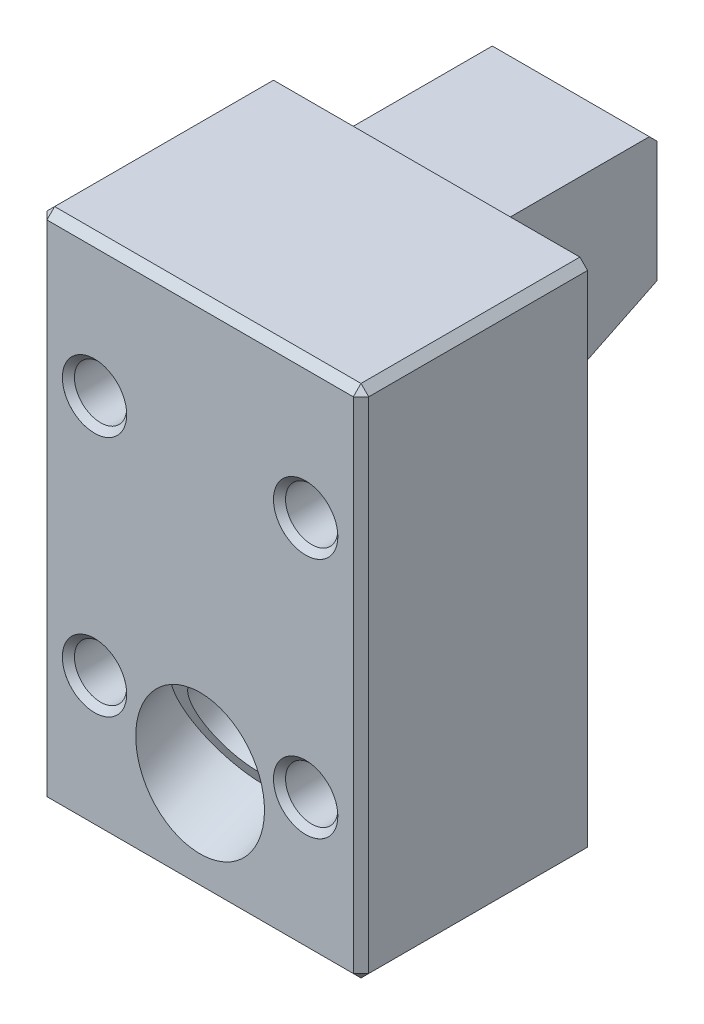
ISO-10303-21;
HEADER;
FILE_DESCRIPTION(('STEP AP214'),'2;1');
FILE_NAME('part.step','',(''),(''),'','','');
FILE_SCHEMA(('AUTOMOTIVE_DESIGN { 1 0 10303 214 1 1 1 1 }'));
ENDSEC;
DATA;
#1=APPLICATION_CONTEXT('core data for automotive mechanical design processes');
#2=APPLICATION_PROTOCOL_DEFINITION('international standard','automotive_design',2000,#1);
#3=PRODUCT_CONTEXT('',#1,'mechanical');
#4=PRODUCT('Part','Part','',(#3));
#5=PRODUCT_RELATED_PRODUCT_CATEGORY('part','',(#4));
#6=PRODUCT_DEFINITION_FORMATION('','',#4);
#7=PRODUCT_DEFINITION_CONTEXT('part definition',#1,'design');
#8=PRODUCT_DEFINITION('design','',#6,#7);
#9=PRODUCT_DEFINITION_SHAPE('','',#8);
#10=(LENGTH_UNIT() NAMED_UNIT(*) SI_UNIT(.MILLI.,.METRE.));
#11=(NAMED_UNIT(*) PLANE_ANGLE_UNIT() SI_UNIT($,.RADIAN.));
#12=(NAMED_UNIT(*) SI_UNIT($,.STERADIAN.) SOLID_ANGLE_UNIT());
#13=UNCERTAINTY_MEASURE_WITH_UNIT(LENGTH_MEASURE(1.E-05),#10,'distance_accuracy_value','');
#14=(GEOMETRIC_REPRESENTATION_CONTEXT(3) GLOBAL_UNCERTAINTY_ASSIGNED_CONTEXT((#13)) GLOBAL_UNIT_ASSIGNED_CONTEXT((#10,
#11,#12)) REPRESENTATION_CONTEXT('',''));
#15=CARTESIAN_POINT('',(0.,0.,0.));
#16=DIRECTION('',(0.,0.,1.));
#17=DIRECTION('',(1.,0.,0.));
#18=AXIS2_PLACEMENT_3D('',#15,#16,#17);
#19=CARTESIAN_POINT('',(5.207,6.731,3.4417));
#20=DIRECTION('',(0.,0.,1.));
#21=DIRECTION('',(1.,0.,0.));
#22=AXIS2_PLACEMENT_3D('',#19,#20,#21);
#23=CYLINDRICAL_SURFACE('',#22,1.28905);
#24=CARTESIAN_POINT('',(5.207,6.731,10.87755));
#25=DIRECTION('',(0.,0.,-1.));
#26=DIRECTION('',(-1.,0.,0.));
#27=AXIS2_PLACEMENT_3D('',#24,#25,#26);
#28=CIRCLE('',#27,1.28905);
#29=CARTESIAN_POINT('',(3.91795,6.731,10.87755));
#30=VERTEX_POINT('',#29);
#31=EDGE_CURVE('E690',#30,#30,#28,.F.);
#32=ORIENTED_EDGE('',*,*,#31,.T.);
#33=EDGE_LOOP('',(#32));
#34=FACE_BOUND('',#33,.T.);
#35=CARTESIAN_POINT('',(5.207,6.731,3.8608));
#36=DIRECTION('',(0.,0.,-1.));
#37=DIRECTION('',(-1.,0.,0.));
#38=AXIS2_PLACEMENT_3D('',#35,#36,#37);
#39=CIRCLE('',#38,1.28905);
#40=CARTESIAN_POINT('',(3.91795,6.731,3.8608));
#41=VERTEX_POINT('',#40);
#42=EDGE_CURVE('E456',#41,#41,#39,.T.);
#43=ORIENTED_EDGE('',*,*,#42,.T.);
#44=EDGE_LOOP('',(#43));
#45=FACE_BOUND('',#44,.T.);
#46=ADVANCED_FACE('F15',(#34,#45),#23,.F.);
#47=CARTESIAN_POINT('',(-5.207,18.669,3.4417));
#48=DIRECTION('',(0.,0.,1.));
#49=DIRECTION('',(1.,0.,0.));
#50=AXIS2_PLACEMENT_3D('',#47,#48,#49);
#51=CYLINDRICAL_SURFACE('',#50,1.28905);
#52=CARTESIAN_POINT('',(-5.207,18.669,10.87755));
#53=DIRECTION('',(0.,0.,-1.));
#54=DIRECTION('',(-1.,0.,0.));
#55=AXIS2_PLACEMENT_3D('',#52,#53,#54);
#56=CIRCLE('',#55,1.28905);
#57=CARTESIAN_POINT('',(-6.49605,18.669,10.87755));
#58=VERTEX_POINT('',#57);
#59=EDGE_CURVE('E23',#58,#58,#56,.F.);
#60=ORIENTED_EDGE('',*,*,#59,.T.);
#61=EDGE_LOOP('',(#60));
#62=FACE_BOUND('',#61,.T.);
#63=CARTESIAN_POINT('',(-5.207,18.669,3.8608));
#64=DIRECTION('',(0.,0.,-1.));
#65=DIRECTION('',(-1.,0.,0.));
#66=AXIS2_PLACEMENT_3D('',#63,#64,#65);
#67=CIRCLE('',#66,1.28905);
#68=CARTESIAN_POINT('',(-6.49605,18.669,3.8608));
#69=VERTEX_POINT('',#68);
#70=EDGE_CURVE('E462',#69,#69,#67,.T.);
#71=ORIENTED_EDGE('',*,*,#70,.T.);
#72=EDGE_LOOP('',(#71));
#73=FACE_BOUND('',#72,.T.);
#74=ADVANCED_FACE('F714',(#62,#73),#51,.F.);
#75=CARTESIAN_POINT('',(5.207,18.669,3.4417));
#76=DIRECTION('',(0.,0.,1.));
#77=DIRECTION('',(1.,0.,0.));
#78=AXIS2_PLACEMENT_3D('',#75,#76,#77);
#79=CYLINDRICAL_SURFACE('',#78,1.28905);
#80=CARTESIAN_POINT('',(5.207,18.669,10.87755));
#81=DIRECTION('',(0.,0.,-1.));
#82=DIRECTION('',(-1.,0.,0.));
#83=AXIS2_PLACEMENT_3D('',#80,#81,#82);
#84=CIRCLE('',#83,1.28905);
#85=CARTESIAN_POINT('',(3.91795,18.669,10.87755));
#86=VERTEX_POINT('',#85);
#87=EDGE_CURVE('E709',#86,#86,#84,.F.);
#88=ORIENTED_EDGE('',*,*,#87,.T.);
#89=EDGE_LOOP('',(#88));
#90=FACE_BOUND('',#89,.T.);
#91=CARTESIAN_POINT('',(5.207,18.669,3.8608));
#92=DIRECTION('',(0.,0.,-1.));
#93=DIRECTION('',(-1.,0.,0.));
#94=AXIS2_PLACEMENT_3D('',#91,#92,#93);
#95=CIRCLE('',#94,1.28905);
#96=CARTESIAN_POINT('',(3.91795,18.669,3.8608));
#97=VERTEX_POINT('',#96);
#98=EDGE_CURVE('E459',#97,#97,#95,.T.);
#99=ORIENTED_EDGE('',*,*,#98,.T.);
#100=EDGE_LOOP('',(#99));
#101=FACE_BOUND('',#100,.T.);
#102=ADVANCED_FACE('F739',(#90,#101),#79,.F.);
#103=CARTESIAN_POINT('',(0.,25.4,11.176));
#104=DIRECTION('',(0.,0.,-1.));
#105=DIRECTION('',(-1.,0.,0.));
#106=AXIS2_PLACEMENT_3D('',#103,#104,#105);
#107=PLANE('',#106);
#108=DIRECTION('',(1.,0.,0.));
#109=VECTOR('',#108,1.);
#110=CARTESIAN_POINT('',(-3.6195,6.731,11.176));
#111=LINE('',#110,#109);
#112=CARTESIAN_POINT('',(-3.619246,6.731,11.176));
#113=VERTEX_POINT('',#112);
#114=CARTESIAN_POINT('',(-3.6195,6.731,11.176));
#115=VERTEX_POINT('',#114);
#116=EDGE_CURVE('E30',#113,#115,#111,.F.);
#117=ORIENTED_EDGE('',*,*,#116,.T.);
#118=CARTESIAN_POINT('',(-5.207,6.731,11.176));
#119=DIRECTION('',(0.,0.,-1.));
#120=DIRECTION('',(-1.,0.,0.));
#121=AXIS2_PLACEMENT_3D('',#118,#119,#120);
#122=CIRCLE('',#121,1.5875);
#123=CARTESIAN_POINT('',(-3.6195001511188,6.73030732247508,11.176));
#124=VERTEX_POINT('',#123);
#125=EDGE_CURVE('E697',#115,#124,#122,.T.);
#126=ORIENTED_EDGE('',*,*,#125,.T.);
#127=DIRECTION('',(0.999999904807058,-0.000436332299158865,0.));
#128=VECTOR('',#127,1.);
#129=CARTESIAN_POINT('',(-3.6195001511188,6.73030732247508,11.176));
#130=LINE('',#129,#128);
#131=CARTESIAN_POINT('',(-3.61924615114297,6.73030721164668,11.176));
#132=VERTEX_POINT('',#131);
#133=EDGE_CURVE('E338',#132,#124,#130,.F.);
#134=ORIENTED_EDGE('',*,*,#133,.F.);
#135=CARTESIAN_POINT('',(-5.207,6.731,11.176));
#136=DIRECTION('',(0.,0.,1.));
#137=DIRECTION('',(1.,0.,0.));
#138=AXIS2_PLACEMENT_3D('',#135,#136,#137);
#139=CIRCLE('',#138,1.587754);
#140=EDGE_CURVE('E1648',#113,#132,#139,.T.);
#141=ORIENTED_EDGE('',*,*,#140,.F.);
#142=EDGE_LOOP('',(#117,#126,#134,#141));
#143=FACE_BOUND('',#142,.T.);
#144=DIRECTION('',(1.,0.,0.));
#145=VECTOR('',#144,1.);
#146=CARTESIAN_POINT('',(6.7945,6.731,11.176));
#147=LINE('',#146,#145);
#148=CARTESIAN_POINT('',(6.794754,6.731,11.176));
#149=VERTEX_POINT('',#148);
#150=CARTESIAN_POINT('',(6.7945,6.731,11.176));
#151=VERTEX_POINT('',#150);
#152=EDGE_CURVE('E450',#149,#151,#147,.F.);
#153=ORIENTED_EDGE('',*,*,#152,.T.);
#154=CARTESIAN_POINT('',(5.207,6.731,11.176));
#155=DIRECTION('',(0.,0.,-1.));
#156=DIRECTION('',(-1.,0.,0.));
#157=AXIS2_PLACEMENT_3D('',#154,#155,#156);
#158=CIRCLE('',#157,1.5875);
#159=CARTESIAN_POINT('',(6.7944998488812,6.73030732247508,11.176));
#160=VERTEX_POINT('',#159);
#161=EDGE_CURVE('E706',#151,#160,#158,.T.);
#162=ORIENTED_EDGE('',*,*,#161,.T.);
#163=DIRECTION('',(0.999999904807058,-0.000436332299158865,0.));
#164=VECTOR('',#163,1.);
#165=CARTESIAN_POINT('',(6.7944998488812,6.73030732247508,11.176));
#166=LINE('',#165,#164);
#167=CARTESIAN_POINT('',(6.79475384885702,6.73030721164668,11.176));
#168=VERTEX_POINT('',#167);
#169=EDGE_CURVE('E453',#168,#160,#166,.F.);
#170=ORIENTED_EDGE('',*,*,#169,.F.);
#171=CARTESIAN_POINT('',(5.207,6.731,11.176));
#172=DIRECTION('',(0.,0.,1.));
#173=DIRECTION('',(1.,0.,0.));
#174=AXIS2_PLACEMENT_3D('',#171,#172,#173);
#175=CIRCLE('',#174,1.587754);
#176=EDGE_CURVE('E403',#149,#168,#175,.T.);
#177=ORIENTED_EDGE('',*,*,#176,.F.);
#178=EDGE_LOOP('',(#153,#162,#170,#177));
#179=FACE_BOUND('',#178,.T.);
#180=DIRECTION('',(0.,-1.,0.));
#181=VECTOR('',#180,1.);
#182=CARTESIAN_POINT('',(-7.5565,0.,11.176));
#183=LINE('',#182,#181);
#184=CARTESIAN_POINT('',(-7.5565,25.019,11.176));
#185=VERTEX_POINT('',#184);
#186=CARTESIAN_POINT('',(-7.5565,0.381,11.176));
#187=VERTEX_POINT('',#186);
#188=EDGE_CURVE('E614',#185,#187,#183,.T.);
#189=ORIENTED_EDGE('',*,*,#188,.T.);
#190=DIRECTION('',(1.,0.,0.));
#191=VECTOR('',#190,1.);
#192=CARTESIAN_POINT('',(7.9375,0.381,11.176));
#193=LINE('',#192,#191);
#194=CARTESIAN_POINT('',(7.5565,0.381,11.176));
#195=VERTEX_POINT('',#194);
#196=EDGE_CURVE('E620',#187,#195,#193,.T.);
#197=ORIENTED_EDGE('',*,*,#196,.T.);
#198=DIRECTION('',(0.,1.,0.));
#199=VECTOR('',#198,1.);
#200=CARTESIAN_POINT('',(7.5565,25.4,11.176));
#201=LINE('',#200,#199);
#202=CARTESIAN_POINT('',(7.5565,25.019,11.176));
#203=VERTEX_POINT('',#202);
#204=EDGE_CURVE('E618',#195,#203,#201,.T.);
#205=ORIENTED_EDGE('',*,*,#204,.T.);
#206=DIRECTION('',(-1.,0.,0.));
#207=VECTOR('',#206,1.);
#208=CARTESIAN_POINT('',(0.,25.019,11.176));
#209=LINE('',#208,#207);
#210=EDGE_CURVE('E616',#203,#185,#209,.T.);
#211=ORIENTED_EDGE('',*,*,#210,.T.);
#212=EDGE_LOOP('',(#189,#197,#205,#211));
#213=FACE_BOUND('',#212,.T.);
#214=CARTESIAN_POINT('',(0.,5.16206945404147,11.176));
#215=DIRECTION('',(0.,0.,-1.));
#216=DIRECTION('',(0.,1.,0.));
#217=AXIS2_PLACEMENT_3D('',#214,#215,#216);
#218=ELLIPSE('',#217,3.44919419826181,3.175);
#219=CARTESIAN_POINT('',(0.,8.61126365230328,11.176));
#220=VERTEX_POINT('',#219);
#221=EDGE_CURVE('E573',#220,#220,#218,.F.);
#222=ORIENTED_EDGE('',*,*,#221,.F.);
#223=EDGE_LOOP('',(#222));
#224=FACE_BOUND('',#223,.T.);
#225=DIRECTION('',(1.,0.,0.));
#226=VECTOR('',#225,1.);
#227=CARTESIAN_POINT('',(-3.6195,18.669,11.176));
#228=LINE('',#227,#226);
#229=CARTESIAN_POINT('',(-3.619246,18.669,11.176));
#230=VERTEX_POINT('',#229);
#231=CARTESIAN_POINT('',(-3.6195,18.669,11.176));
#232=VERTEX_POINT('',#231);
#233=EDGE_CURVE('E521',#230,#232,#228,.F.);
#234=ORIENTED_EDGE('',*,*,#233,.T.);
#235=CARTESIAN_POINT('',(-5.207,18.669,11.176));
#236=DIRECTION('',(0.,0.,-1.));
#237=DIRECTION('',(-1.,0.,0.));
#238=AXIS2_PLACEMENT_3D('',#235,#236,#237);
#239=CIRCLE('',#238,1.5875);
#240=CARTESIAN_POINT('',(-3.6195001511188,18.6683073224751,11.176));
#241=VERTEX_POINT('',#240);
#242=EDGE_CURVE('E700',#232,#241,#239,.T.);
#243=ORIENTED_EDGE('',*,*,#242,.T.);
#244=DIRECTION('',(0.999999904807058,-0.000436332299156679,0.));
#245=VECTOR('',#244,1.);
#246=CARTESIAN_POINT('',(-3.6195001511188,18.6683073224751,11.176));
#247=LINE('',#246,#245);
#248=CARTESIAN_POINT('',(-3.61924615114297,18.6683072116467,11.176));
#249=VERTEX_POINT('',#248);
#250=EDGE_CURVE('E524',#249,#241,#247,.F.);
#251=ORIENTED_EDGE('',*,*,#250,.F.);
#252=CARTESIAN_POINT('',(-5.207,18.669,11.176));
#253=DIRECTION('',(0.,0.,1.));
#254=DIRECTION('',(1.,0.,0.));
#255=AXIS2_PLACEMENT_3D('',#252,#253,#254);
#256=CIRCLE('',#255,1.587754);
#257=EDGE_CURVE('E474',#230,#249,#256,.T.);
#258=ORIENTED_EDGE('',*,*,#257,.F.);
#259=EDGE_LOOP('',(#234,#243,#251,#258));
#260=FACE_BOUND('',#259,.T.);
#261=DIRECTION('',(1.,0.,0.));
#262=VECTOR('',#261,1.);
#263=CARTESIAN_POINT('',(6.7945,18.669,11.176));
#264=LINE('',#263,#262);
#265=CARTESIAN_POINT('',(6.794754,18.669,11.176));
#266=VERTEX_POINT('',#265);
#267=CARTESIAN_POINT('',(6.7945,18.669,11.176));
#268=VERTEX_POINT('',#267);
#269=EDGE_CURVE('E38',#266,#268,#264,.F.);
#270=ORIENTED_EDGE('',*,*,#269,.T.);
#271=CARTESIAN_POINT('',(5.207,18.669,11.176));
#272=DIRECTION('',(0.,0.,-1.));
#273=DIRECTION('',(-1.,0.,0.));
#274=AXIS2_PLACEMENT_3D('',#271,#272,#273);
#275=CIRCLE('',#274,1.5875);
#276=CARTESIAN_POINT('',(6.7944998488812,18.6683073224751,11.176));
#277=VERTEX_POINT('',#276);
#278=EDGE_CURVE('E703',#268,#277,#275,.T.);
#279=ORIENTED_EDGE('',*,*,#278,.T.);
#280=DIRECTION('',(0.999999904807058,-0.00043633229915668,0.));
#281=VECTOR('',#280,1.);
#282=CARTESIAN_POINT('',(6.7944998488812,18.6683073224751,11.176));
#283=LINE('',#282,#281);
#284=CARTESIAN_POINT('',(6.79475384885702,18.6683072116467,11.176));
#285=VERTEX_POINT('',#284);
#286=EDGE_CURVE('E394',#285,#277,#283,.F.);
#287=ORIENTED_EDGE('',*,*,#286,.F.);
#288=CARTESIAN_POINT('',(5.207,18.669,11.176));
#289=DIRECTION('',(0.,0.,1.));
#290=DIRECTION('',(1.,0.,0.));
#291=AXIS2_PLACEMENT_3D('',#288,#289,#290);
#292=CIRCLE('',#291,1.587754);
#293=EDGE_CURVE('E347',#266,#285,#292,.T.);
#294=ORIENTED_EDGE('',*,*,#293,.F.);
#295=EDGE_LOOP('',(#270,#279,#287,#294));
#296=FACE_BOUND('',#295,.T.);
#297=ADVANCED_FACE('F765',(#143,#179,#213,#224,#260,#296),#107,.F.);
#298=CARTESIAN_POINT('',(-5.207,6.731,3.8608));
#299=DIRECTION('',(0.,0.,1.));
#300=DIRECTION('',(1.,0.,0.));
#301=AXIS2_PLACEMENT_3D('',#298,#299,#300);
#302=CYLINDRICAL_SURFACE('',#301,1.28905);
#303=CARTESIAN_POINT('',(-5.207,6.731,10.87755));
#304=DIRECTION('',(0.,0.,-1.));
#305=DIRECTION('',(-1.,0.,0.));
#306=AXIS2_PLACEMENT_3D('',#303,#304,#305);
#307=CIRCLE('',#306,1.28905);
#308=CARTESIAN_POINT('',(-6.49605,6.731,10.87755));
#309=VERTEX_POINT('',#308);
#310=EDGE_CURVE('E9',#309,#309,#307,.F.);
#311=ORIENTED_EDGE('',*,*,#310,.T.);
#312=EDGE_LOOP('',(#311));
#313=FACE_BOUND('',#312,.T.);
#314=CARTESIAN_POINT('',(-5.207,6.731,3.8608));
#315=DIRECTION('',(0.,0.,-1.));
#316=DIRECTION('',(-1.,0.,0.));
#317=AXIS2_PLACEMENT_3D('',#314,#315,#316);
#318=CIRCLE('',#317,1.28905);
#319=CARTESIAN_POINT('',(-6.49605,6.731,3.8608));
#320=VERTEX_POINT('',#319);
#321=EDGE_CURVE('E465',#320,#320,#318,.T.);
#322=ORIENTED_EDGE('',*,*,#321,.T.);
#323=EDGE_LOOP('',(#322));
#324=FACE_BOUND('',#323,.T.);
#325=ADVANCED_FACE('F768',(#313,#324),#302,.F.);
#326=CARTESIAN_POINT('',(-3.8735,25.4,0.));
#327=DIRECTION('',(-1.,0.,0.));
#328=DIRECTION('',(0.,0.,1.));
#329=AXIS2_PLACEMENT_3D('',#326,#327,#328);
#330=PLANE('',#329);
#331=DIRECTION('',(0.,-1.,0.));
#332=VECTOR('',#331,1.);
#333=CARTESIAN_POINT('',(-3.8735,18.9915361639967,-7.493));
#334=LINE('',#333,#332);
#335=CARTESIAN_POINT('',(-3.8735,24.765,-7.493));
#336=VERTEX_POINT('',#335);
#337=CARTESIAN_POINT('',(-3.8735,18.8077752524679,-7.493));
#338=VERTEX_POINT('',#337);
#339=EDGE_CURVE('E661',#336,#338,#334,.T.);
#340=ORIENTED_EDGE('',*,*,#339,.T.);
#341=CARTESIAN_POINT('',(-3.8735,19.4676866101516,-7.112));
#342=DIRECTION('',(-1.,0.,0.));
#343=DIRECTION('',(0.,0.,1.));
#344=AXIS2_PLACEMENT_3D('',#341,#342,#343);
#345=CIRCLE('',#344,0.762);
#346=CARTESIAN_POINT('',(-3.8735,18.7828055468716,-7.44603881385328));
#347=VERTEX_POINT('',#346);
#348=EDGE_CURVE('E669',#338,#347,#345,.T.);
#349=ORIENTED_EDGE('',*,*,#348,.T.);
#350=DIRECTION('',(0.,0.438371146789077,-0.898794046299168));
#351=VECTOR('',#350,1.);
#352=CARTESIAN_POINT('',(-3.8735,17.1206475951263,-4.03810998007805));
#353=LINE('',#352,#351);
#354=CARTESIAN_POINT('',(-3.8735,15.6033794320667,-0.927249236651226));
#355=VERTEX_POINT('',#354);
#356=EDGE_CURVE('E572',#355,#347,#353,.T.);
#357=ORIENTED_EDGE('',*,*,#356,.F.);
#358=CARTESIAN_POINT('',(-3.8735,14.1194704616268,-1.651));
#359=DIRECTION('',(-1.,0.,0.));
#360=DIRECTION('',(0.,0.,1.));
#361=AXIS2_PLACEMENT_3D('',#358,#359,#360);
#362=CIRCLE('',#361,1.651);
#363=CARTESIAN_POINT('',(-3.8735,14.1194704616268,0.));
#364=VERTEX_POINT('',#363);
#365=EDGE_CURVE('E685',#355,#364,#362,.F.);
#366=ORIENTED_EDGE('',*,*,#365,.T.);
#367=DIRECTION('',(0.,-1.,0.));
#368=VECTOR('',#367,1.);
#369=CARTESIAN_POINT('',(-3.8735,25.4,0.));
#370=LINE('',#369,#368);
#371=CARTESIAN_POINT('',(-3.8735,25.146,0.));
#372=VERTEX_POINT('',#371);
#373=EDGE_CURVE('E585',#372,#364,#370,.T.);
#374=ORIENTED_EDGE('',*,*,#373,.F.);
#375=DIRECTION('',(0.,0.,1.));
#376=VECTOR('',#375,1.);
#377=CARTESIAN_POINT('',(-3.8735,25.146,-7.874));
#378=LINE('',#377,#376);
#379=CARTESIAN_POINT('',(-3.8735,25.146,-7.112));
#380=VERTEX_POINT('',#379);
#381=EDGE_CURVE('E531',#380,#372,#378,.T.);
#382=ORIENTED_EDGE('',*,*,#381,.F.);
#383=DIRECTION('',(0.,-0.707106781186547,-0.707106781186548));
#384=VECTOR('',#383,1.);
#385=CARTESIAN_POINT('',(-3.8735,28.829,-3.429));
#386=LINE('',#385,#384);
#387=EDGE_CURVE('E642',#380,#336,#386,.T.);
#388=ORIENTED_EDGE('',*,*,#387,.T.);
#389=EDGE_LOOP('',(#340,#349,#357,#366,#374,#382,#388));
#390=FACE_BOUND('',#389,.T.);
#391=ADVANCED_FACE('F780',(#390),#330,.T.);
#392=CARTESIAN_POINT('',(3.8735,25.4,0.));
#393=DIRECTION('',(-1.,0.,0.));
#394=DIRECTION('',(0.,0.,1.));
#395=AXIS2_PLACEMENT_3D('',#392,#393,#394);
#396=PLANE('',#395);
#397=DIRECTION('',(0.,-1.,0.));
#398=VECTOR('',#397,1.);
#399=CARTESIAN_POINT('',(3.8735,25.4,0.));
#400=LINE('',#399,#398);
#401=CARTESIAN_POINT('',(3.8735,25.146,0.));
#402=VERTEX_POINT('',#401);
#403=CARTESIAN_POINT('',(3.8735,14.1194704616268,0.));
#404=VERTEX_POINT('',#403);
#405=EDGE_CURVE('E587',#402,#404,#400,.T.);
#406=ORIENTED_EDGE('',*,*,#405,.T.);
#407=CARTESIAN_POINT('',(3.8735,14.1194704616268,-1.651));
#408=DIRECTION('',(-1.,0.,0.));
#409=DIRECTION('',(0.,0.,1.));
#410=AXIS2_PLACEMENT_3D('',#407,#408,#409);
#411=CIRCLE('',#410,1.651);
#412=CARTESIAN_POINT('',(3.8735,15.6033794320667,-0.927249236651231));
#413=VERTEX_POINT('',#412);
#414=EDGE_CURVE('E688',#404,#413,#411,.T.);
#415=ORIENTED_EDGE('',*,*,#414,.T.);
#416=DIRECTION('',(0.,0.438371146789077,-0.898794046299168));
#417=VECTOR('',#416,1.);
#418=CARTESIAN_POINT('',(3.8735,17.1206475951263,-4.03810998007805));
#419=LINE('',#418,#417);
#420=CARTESIAN_POINT('',(3.8735,18.7828055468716,-7.44603881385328));
#421=VERTEX_POINT('',#420);
#422=EDGE_CURVE('E570',#413,#421,#419,.T.);
#423=ORIENTED_EDGE('',*,*,#422,.T.);
#424=CARTESIAN_POINT('',(3.8735,19.4676866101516,-7.112));
#425=DIRECTION('',(-1.,0.,0.));
#426=DIRECTION('',(0.,0.,1.));
#427=AXIS2_PLACEMENT_3D('',#424,#425,#426);
#428=CIRCLE('',#427,0.762);
#429=CARTESIAN_POINT('',(3.8735,18.8077752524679,-7.493));
#430=VERTEX_POINT('',#429);
#431=EDGE_CURVE('E675',#421,#430,#428,.F.);
#432=ORIENTED_EDGE('',*,*,#431,.T.);
#433=DIRECTION('',(0.,1.,0.));
#434=VECTOR('',#433,1.);
#435=CARTESIAN_POINT('',(3.8735,25.4,-7.493));
#436=LINE('',#435,#434);
#437=CARTESIAN_POINT('',(3.8735,24.765,-7.493));
#438=VERTEX_POINT('',#437);
#439=EDGE_CURVE('E655',#430,#438,#436,.T.);
#440=ORIENTED_EDGE('',*,*,#439,.T.);
#441=DIRECTION('',(0.,0.707106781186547,0.707106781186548));
#442=VECTOR('',#441,1.);
#443=CARTESIAN_POINT('',(3.8735,25.146,-7.112));
#444=LINE('',#443,#442);
#445=CARTESIAN_POINT('',(3.8735,25.146,-7.112));
#446=VERTEX_POINT('',#445);
#447=EDGE_CURVE('E648',#438,#446,#444,.T.);
#448=ORIENTED_EDGE('',*,*,#447,.T.);
#449=DIRECTION('',(0.,0.,1.));
#450=VECTOR('',#449,1.);
#451=CARTESIAN_POINT('',(3.8735,25.146,-7.874));
#452=LINE('',#451,#450);
#453=EDGE_CURVE('E530',#446,#402,#452,.T.);
#454=ORIENTED_EDGE('',*,*,#453,.T.);
#455=EDGE_LOOP('',(#406,#415,#423,#432,#440,#448,#454));
#456=FACE_BOUND('',#455,.T.);
#457=ADVANCED_FACE('F777',(#456),#396,.F.);
#458=CARTESIAN_POINT('',(3.8735,25.4,-7.874));
#459=DIRECTION('',(0.,0.,1.));
#460=DIRECTION('',(1.,0.,0.));
#461=AXIS2_PLACEMENT_3D('',#458,#459,#460);
#462=PLANE('',#461);
#463=DIRECTION('',(0.,-1.,0.));
#464=VECTOR('',#463,1.);
#465=CARTESIAN_POINT('',(3.4925,25.4,-7.874));
#466=LINE('',#465,#464);
#467=CARTESIAN_POINT('',(3.4925,24.384,-7.874));
#468=VERTEX_POINT('',#467);
#469=CARTESIAN_POINT('',(3.4925,19.4676866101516,-7.874));
#470=VERTEX_POINT('',#469);
#471=EDGE_CURVE('E652',#468,#470,#466,.T.);
#472=ORIENTED_EDGE('',*,*,#471,.T.);
#473=DIRECTION('',(-1.,0.,0.));
#474=VECTOR('',#473,1.);
#475=CARTESIAN_POINT('',(3.8735,19.4676866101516,-7.874));
#476=LINE('',#475,#474);
#477=CARTESIAN_POINT('',(-3.4925,19.4676866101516,-7.874));
#478=VERTEX_POINT('',#477);
#479=EDGE_CURVE('E664',#470,#478,#476,.T.);
#480=ORIENTED_EDGE('',*,*,#479,.T.);
#481=DIRECTION('',(0.,1.,0.));
#482=VECTOR('',#481,1.);
#483=CARTESIAN_POINT('',(-3.4925,24.384,-7.874));
#484=LINE('',#483,#482);
#485=CARTESIAN_POINT('',(-3.4925,24.384,-7.874));
#486=VERTEX_POINT('',#485);
#487=EDGE_CURVE('E650',#478,#486,#484,.T.);
#488=ORIENTED_EDGE('',*,*,#487,.T.);
#489=DIRECTION('',(1.,0.,0.));
#490=VECTOR('',#489,1.);
#491=CARTESIAN_POINT('',(3.8735,24.384,-7.874));
#492=LINE('',#491,#490);
#493=EDGE_CURVE('E645',#486,#468,#492,.T.);
#494=ORIENTED_EDGE('',*,*,#493,.T.);
#495=EDGE_LOOP('',(#472,#480,#488,#494));
#496=FACE_BOUND('',#495,.T.);
#497=ADVANCED_FACE('F763',(#496),#462,.F.);
#498=CARTESIAN_POINT('',(-7.9375,25.4,11.176));
#499=DIRECTION('',(0.,-1.,0.));
#500=DIRECTION('',(0.,0.,-1.));
#501=AXIS2_PLACEMENT_3D('',#498,#499,#500);
#502=PLANE('',#501);
#503=DIRECTION('',(0.,0.,-1.));
#504=VECTOR('',#503,1.);
#505=CARTESIAN_POINT('',(7.5565,25.4,11.176));
#506=LINE('',#505,#504);
#507=CARTESIAN_POINT('',(7.5565,25.4,10.795));
#508=VERTEX_POINT('',#507);
#509=CARTESIAN_POINT('',(7.5565,25.4,0.));
#510=VERTEX_POINT('',#509);
#511=EDGE_CURVE('E633',#508,#510,#506,.T.);
#512=ORIENTED_EDGE('',*,*,#511,.T.);
#513=DIRECTION('',(1.,0.,0.));
#514=VECTOR('',#513,1.);
#515=CARTESIAN_POINT('',(-7.9375,25.4,0.));
#516=LINE('',#515,#514);
#517=CARTESIAN_POINT('',(-7.5565,25.4,0.));
#518=VERTEX_POINT('',#517);
#519=EDGE_CURVE('E578',#518,#510,#516,.T.);
#520=ORIENTED_EDGE('',*,*,#519,.F.);
#521=DIRECTION('',(0.,0.,1.));
#522=VECTOR('',#521,1.);
#523=CARTESIAN_POINT('',(-7.5565,25.4,11.176));
#524=LINE('',#523,#522);
#525=CARTESIAN_POINT('',(-7.5565,25.4,10.795));
#526=VERTEX_POINT('',#525);
#527=EDGE_CURVE('E629',#518,#526,#524,.T.);
#528=ORIENTED_EDGE('',*,*,#527,.T.);
#529=DIRECTION('',(1.,0.,0.));
#530=VECTOR('',#529,1.);
#531=CARTESIAN_POINT('',(-7.9375,25.4,10.795));
#532=LINE('',#531,#530);
#533=EDGE_CURVE('E631',#526,#508,#532,.T.);
#534=ORIENTED_EDGE('',*,*,#533,.T.);
#535=EDGE_LOOP('',(#512,#520,#528,#534));
#536=FACE_BOUND('',#535,.T.);
#537=ADVANCED_FACE('F759',(#536),#502,.F.);
#538=CARTESIAN_POINT('',(-7.9375,0.,11.176));
#539=DIRECTION('',(0.,-1.,0.));
#540=DIRECTION('',(0.,0.,-1.));
#541=AXIS2_PLACEMENT_3D('',#538,#539,#540);
#542=PLANE('',#541);
#543=DIRECTION('',(-1.,0.,0.));
#544=VECTOR('',#543,1.);
#545=CARTESIAN_POINT('',(-7.9375,0.,10.795));
#546=LINE('',#545,#544);
#547=CARTESIAN_POINT('',(7.5565,0.,10.795));
#548=VERTEX_POINT('',#547);
#549=CARTESIAN_POINT('',(-7.5565,0.,10.795));
#550=VERTEX_POINT('',#549);
#551=EDGE_CURVE('E595',#548,#550,#546,.T.);
#552=ORIENTED_EDGE('',*,*,#551,.T.);
#553=DIRECTION('',(0.,0.,-1.));
#554=VECTOR('',#553,1.);
#555=CARTESIAN_POINT('',(-7.5565,0.,11.176));
#556=LINE('',#555,#554);
#557=CARTESIAN_POINT('',(-7.5565,0.,0.));
#558=VERTEX_POINT('',#557);
#559=EDGE_CURVE('E597',#550,#558,#556,.T.);
#560=ORIENTED_EDGE('',*,*,#559,.T.);
#561=DIRECTION('',(-1.,0.,0.));
#562=VECTOR('',#561,1.);
#563=CARTESIAN_POINT('',(7.9375,0.,0.));
#564=LINE('',#563,#562);
#565=CARTESIAN_POINT('',(7.5565,0.,0.));
#566=VERTEX_POINT('',#565);
#567=EDGE_CURVE('E575',#566,#558,#564,.T.);
#568=ORIENTED_EDGE('',*,*,#567,.F.);
#569=DIRECTION('',(0.,0.,1.));
#570=VECTOR('',#569,1.);
#571=CARTESIAN_POINT('',(7.5565,0.,11.176));
#572=LINE('',#571,#570);
#573=EDGE_CURVE('E584',#566,#548,#572,.T.);
#574=ORIENTED_EDGE('',*,*,#573,.T.);
#575=EDGE_LOOP('',(#552,#560,#568,#574));
#576=FACE_BOUND('',#575,.T.);
#577=ADVANCED_FACE('F755',(#576),#542,.T.);
#578=CARTESIAN_POINT('',(-7.9375,25.4,11.176));
#579=DIRECTION('',(-1.,0.,0.));
#580=DIRECTION('',(0.,0.,1.));
#581=AXIS2_PLACEMENT_3D('',#578,#579,#580);
#582=PLANE('',#581);
#583=DIRECTION('',(0.,-1.,0.));
#584=VECTOR('',#583,1.);
#585=CARTESIAN_POINT('',(-7.9375,25.4,0.));
#586=LINE('',#585,#584);
#587=CARTESIAN_POINT('',(-7.9375,25.019,0.));
#588=VERTEX_POINT('',#587);
#589=CARTESIAN_POINT('',(-7.9375,0.381,0.));
#590=VERTEX_POINT('',#589);
#591=EDGE_CURVE('E581',#588,#590,#586,.T.);
#592=ORIENTED_EDGE('',*,*,#591,.T.);
#593=DIRECTION('',(0.,0.,1.));
#594=VECTOR('',#593,1.);
#595=CARTESIAN_POINT('',(-7.9375,0.381,11.176));
#596=LINE('',#595,#594);
#597=CARTESIAN_POINT('',(-7.9375,0.381,10.795));
#598=VERTEX_POINT('',#597);
#599=EDGE_CURVE('E612',#590,#598,#596,.T.);
#600=ORIENTED_EDGE('',*,*,#599,.T.);
#601=DIRECTION('',(0.,1.,0.));
#602=VECTOR('',#601,1.);
#603=CARTESIAN_POINT('',(-7.9375,25.4,10.795));
#604=LINE('',#603,#602);
#605=CARTESIAN_POINT('',(-7.9375,25.019,10.795));
#606=VERTEX_POINT('',#605);
#607=EDGE_CURVE('E610',#598,#606,#604,.T.);
#608=ORIENTED_EDGE('',*,*,#607,.T.);
#609=DIRECTION('',(0.,0.,-1.));
#610=VECTOR('',#609,1.);
#611=CARTESIAN_POINT('',(-7.9375,25.019,0.));
#612=LINE('',#611,#610);
#613=EDGE_CURVE('E608',#606,#588,#612,.T.);
#614=ORIENTED_EDGE('',*,*,#613,.T.);
#615=EDGE_LOOP('',(#592,#600,#608,#614));
#616=FACE_BOUND('',#615,.T.);
#617=ADVANCED_FACE('F758',(#616),#582,.T.);
#618=CARTESIAN_POINT('',(7.9375,25.4,0.));
#619=DIRECTION('',(0.,0.,1.));
#620=DIRECTION('',(1.,0.,0.));
#621=AXIS2_PLACEMENT_3D('',#618,#619,#620);
#622=PLANE('',#621);
#623=ORIENTED_EDGE('',*,*,#373,.T.);
#624=DIRECTION('',(-1.,0.,0.));
#625=VECTOR('',#624,1.);
#626=CARTESIAN_POINT('',(3.8735,14.1194704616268,0.));
#627=LINE('',#626,#625);
#628=EDGE_CURVE('E682',#364,#404,#627,.F.);
#629=ORIENTED_EDGE('',*,*,#628,.T.);
#630=ORIENTED_EDGE('',*,*,#405,.F.);
#631=DIRECTION('',(1.,0.,0.));
#632=VECTOR('',#631,1.);
#633=CARTESIAN_POINT('',(3.8735,25.146,0.));
#634=LINE('',#633,#632);
#635=EDGE_CURVE('E527',#402,#372,#634,.F.);
#636=ORIENTED_EDGE('',*,*,#635,.T.);
#637=EDGE_LOOP('',(#623,#629,#630,#636));
#638=FACE_BOUND('',#637,.T.);
#639=CARTESIAN_POINT('',(0.,9.906,0.));
#640=DIRECTION('',(0.,0.,1.));
#641=DIRECTION('',(0.,-1.,0.));
#642=AXIS2_PLACEMENT_3D('',#639,#640,#641);
#643=ELLIPSE('',#642,2.58689564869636,2.38125);
#644=CARTESIAN_POINT('',(0.,7.31910435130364,0.));
#645=VERTEX_POINT('',#644);
#646=EDGE_CURVE('E639',#645,#645,#643,.T.);
#647=ORIENTED_EDGE('',*,*,#646,.T.);
#648=EDGE_LOOP('',(#647));
#649=FACE_BOUND('',#648,.T.);
#650=ORIENTED_EDGE('',*,*,#567,.T.);
#651=DIRECTION('',(0.707106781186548,-0.707106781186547,0.));
#652=VECTOR('',#651,1.);
#653=CARTESIAN_POINT('',(-7.5565,0.,0.));
#654=LINE('',#653,#652);
#655=EDGE_CURVE('E606',#558,#590,#654,.F.);
#656=ORIENTED_EDGE('',*,*,#655,.T.);
#657=ORIENTED_EDGE('',*,*,#591,.F.);
#658=DIRECTION('',(0.707106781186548,0.707106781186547,0.));
#659=VECTOR('',#658,1.);
#660=CARTESIAN_POINT('',(-7.9375,25.019,0.));
#661=LINE('',#660,#659);
#662=EDGE_CURVE('E600',#588,#518,#661,.T.);
#663=ORIENTED_EDGE('',*,*,#662,.T.);
#664=ORIENTED_EDGE('',*,*,#519,.T.);
#665=DIRECTION('',(-0.707106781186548,0.707106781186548,0.));
#666=VECTOR('',#665,1.);
#667=CARTESIAN_POINT('',(7.5565,25.4,0.));
#668=LINE('',#667,#666);
#669=CARTESIAN_POINT('',(7.9375,25.019,0.));
#670=VERTEX_POINT('',#669);
#671=EDGE_CURVE('E602',#510,#670,#668,.F.);
#672=ORIENTED_EDGE('',*,*,#671,.T.);
#673=DIRECTION('',(0.,-1.,0.));
#674=VECTOR('',#673,1.);
#675=CARTESIAN_POINT('',(7.9375,25.4,0.));
#676=LINE('',#675,#674);
#677=CARTESIAN_POINT('',(7.9375,0.381000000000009,0.));
#678=VERTEX_POINT('',#677);
#679=EDGE_CURVE('E580',#670,#678,#676,.T.);
#680=ORIENTED_EDGE('',*,*,#679,.T.);
#681=DIRECTION('',(-0.707106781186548,-0.707106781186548,0.));
#682=VECTOR('',#681,1.);
#683=CARTESIAN_POINT('',(7.9375,0.380999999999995,0.));
#684=LINE('',#683,#682);
#685=EDGE_CURVE('E604',#678,#566,#684,.T.);
#686=ORIENTED_EDGE('',*,*,#685,.T.);
#687=EDGE_LOOP('',(#650,#656,#657,#663,#664,#672,#680,#686));
#688=FACE_BOUND('',#687,.T.);
#689=ADVANCED_FACE('F772',(#638,#649,#688),#622,.F.);
#690=CARTESIAN_POINT('',(7.9375,25.4,11.176));
#691=DIRECTION('',(-1.,0.,0.));
#692=DIRECTION('',(0.,0.,1.));
#693=AXIS2_PLACEMENT_3D('',#690,#691,#692);
#694=PLANE('',#693);
#695=DIRECTION('',(0.,-1.,0.));
#696=VECTOR('',#695,1.);
#697=CARTESIAN_POINT('',(7.9375,25.4,10.795));
#698=LINE('',#697,#696);
#699=CARTESIAN_POINT('',(7.9375,25.019,10.795));
#700=VERTEX_POINT('',#699);
#701=CARTESIAN_POINT('',(7.9375,0.381,10.795));
#702=VERTEX_POINT('',#701);
#703=EDGE_CURVE('E623',#700,#702,#698,.T.);
#704=ORIENTED_EDGE('',*,*,#703,.T.);
#705=DIRECTION('',(0.,0.,-1.));
#706=VECTOR('',#705,1.);
#707=CARTESIAN_POINT('',(7.9375,0.381,0.));
#708=LINE('',#707,#706);
#709=EDGE_CURVE('E627',#702,#678,#708,.T.);
#710=ORIENTED_EDGE('',*,*,#709,.T.);
#711=ORIENTED_EDGE('',*,*,#679,.F.);
#712=DIRECTION('',(0.,0.,1.));
#713=VECTOR('',#712,1.);
#714=CARTESIAN_POINT('',(7.9375,25.019,11.176));
#715=LINE('',#714,#713);
#716=EDGE_CURVE('E625',#670,#700,#715,.T.);
#717=ORIENTED_EDGE('',*,*,#716,.T.);
#718=EDGE_LOOP('',(#704,#710,#711,#717));
#719=FACE_BOUND('',#718,.T.);
#720=ADVANCED_FACE('F753',(#719),#694,.F.);
#721=CARTESIAN_POINT('',(77.7094739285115,15.1511297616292,0.));
#722=DIRECTION('',(0.,0.898794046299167,0.438371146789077));
#723=DIRECTION('',(0.,-0.438371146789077,0.898794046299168));
#724=AXIS2_PLACEMENT_3D('',#721,#722,#723);
#725=PLANE('',#724);
#726=ORIENTED_EDGE('',*,*,#422,.F.);
#727=DIRECTION('',(-1.,0.,0.));
#728=VECTOR('',#727,1.);
#729=CARTESIAN_POINT('',(-3.8735,15.6033794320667,-0.927249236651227));
#730=LINE('',#729,#728);
#731=EDGE_CURVE('E679',#413,#355,#730,.T.);
#732=ORIENTED_EDGE('',*,*,#731,.T.);
#733=ORIENTED_EDGE('',*,*,#356,.T.);
#734=DIRECTION('',(-1.,0.,0.));
#735=VECTOR('',#734,1.);
#736=CARTESIAN_POINT('',(77.7094739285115,18.7828055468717,-7.44603881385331));
#737=LINE('',#736,#735);
#738=EDGE_CURVE('E672',#347,#421,#737,.F.);
#739=ORIENTED_EDGE('',*,*,#738,.T.);
#740=EDGE_LOOP('',(#726,#732,#733,#739));
#741=FACE_BOUND('',#740,.T.);
#742=ADVANCED_FACE('F749',(#741),#725,.F.);
#743=CARTESIAN_POINT('',(0.,-3.94328611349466,32.6268734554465));
#744=DIRECTION('',(0.,0.390731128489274,-0.92050485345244));
#745=DIRECTION('',(0.,0.92050485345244,0.390731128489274));
#746=AXIS2_PLACEMENT_3D('',#743,#744,#745);
#747=CYLINDRICAL_SURFACE('',#746,3.175);
#748=CARTESIAN_POINT('',(0.,5.98525437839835,9.23669784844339));
#749=DIRECTION('',(0.,-0.390731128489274,0.920504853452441));
#750=DIRECTION('',(0.,-0.92050485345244,-0.390731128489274));
#751=AXIS2_PLACEMENT_3D('',#748,#749,#750);
#752=CIRCLE('',#751,3.175);
#753=CARTESIAN_POINT('',(0.,3.06265146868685,7.99612651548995));
#754=VERTEX_POINT('',#753);
#755=EDGE_CURVE('E593',#754,#754,#752,.T.);
#756=ORIENTED_EDGE('',*,*,#755,.F.);
#757=EDGE_LOOP('',(#756));
#758=FACE_BOUND('',#757,.T.);
#759=ORIENTED_EDGE('',*,*,#221,.T.);
#760=EDGE_LOOP('',(#759));
#761=FACE_BOUND('',#760,.T.);
#762=ADVANCED_FACE('F745',(#758,#761),#747,.F.);
#763=CARTESIAN_POINT('',(0.,5.98525437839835,9.23669784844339));
#764=DIRECTION('',(0.,-0.390731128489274,0.920504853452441));
#765=DIRECTION('',(0.,-0.92050485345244,-0.390731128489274));
#766=AXIS2_PLACEMENT_3D('',#763,#764,#765);
#767=PLANE('',#766);
#768=CARTESIAN_POINT('',(0.,5.98525437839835,9.2366978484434));
#769=DIRECTION('',(0.,-0.390731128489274,0.920504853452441));
#770=DIRECTION('',(0.,-0.92050485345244,-0.390731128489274));
#771=AXIS2_PLACEMENT_3D('',#768,#769,#770);
#772=CIRCLE('',#771,2.38125);
#773=CARTESIAN_POINT('',(0.,3.79330219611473,8.30626934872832));
#774=VERTEX_POINT('',#773);
#775=EDGE_CURVE('E569',#774,#774,#772,.T.);
#776=ORIENTED_EDGE('',*,*,#775,.F.);
#777=EDGE_LOOP('',(#776));
#778=FACE_BOUND('',#777,.T.);
#779=ORIENTED_EDGE('',*,*,#755,.T.);
#780=EDGE_LOOP('',(#779));
#781=FACE_BOUND('',#780,.T.);
#782=ADVANCED_FACE('F748',(#778,#781),#767,.T.);
#783=CARTESIAN_POINT('',(0.,15.9058552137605,-14.1347730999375));
#784=DIRECTION('',(0.,-0.390731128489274,0.92050485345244));
#785=DIRECTION('',(0.,-0.92050485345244,-0.390731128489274));
#786=AXIS2_PLACEMENT_3D('',#783,#784,#785);
#787=CYLINDRICAL_SURFACE('',#786,2.38125);
#788=ORIENTED_EDGE('',*,*,#775,.T.);
#789=EDGE_LOOP('',(#788));
#790=FACE_BOUND('',#789,.T.);
#791=ORIENTED_EDGE('',*,*,#646,.F.);
#792=EDGE_LOOP('',(#791));
#793=FACE_BOUND('',#792,.T.);
#794=ADVANCED_FACE('F17',(#790,#793),#787,.F.);
#795=CARTESIAN_POINT('',(7.5565,25.4,11.176));
#796=DIRECTION('',(-0.707106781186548,-0.707106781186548,0.));
#797=DIRECTION('',(0.707106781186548,-0.707106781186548,0.));
#798=AXIS2_PLACEMENT_3D('',#795,#796,#797);
#799=PLANE('',#798);
#800=DIRECTION('',(0.707106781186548,-0.707106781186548,0.));
#801=VECTOR('',#800,1.);
#802=CARTESIAN_POINT('',(7.9375,25.019,10.795));
#803=LINE('',#802,#801);
#804=EDGE_CURVE('E566',#700,#508,#803,.F.);
#805=ORIENTED_EDGE('',*,*,#804,.F.);
#806=ORIENTED_EDGE('',*,*,#716,.F.);
#807=ORIENTED_EDGE('',*,*,#671,.F.);
#808=ORIENTED_EDGE('',*,*,#511,.F.);
#809=EDGE_LOOP('',(#805,#806,#807,#808));
#810=FACE_BOUND('',#809,.T.);
#811=ADVANCED_FACE('F908',(#810),#799,.F.);
#812=CARTESIAN_POINT('',(7.9375,25.019,10.795));
#813=DIRECTION('',(0.577350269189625,0.577350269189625,0.577350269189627));
#814=DIRECTION('',(0.707106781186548,0.,-0.707106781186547));
#815=AXIS2_PLACEMENT_3D('',#812,#813,#814);
#816=PLANE('',#815);
#817=DIRECTION('',(-0.707106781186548,0.,0.707106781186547));
#818=VECTOR('',#817,1.);
#819=CARTESIAN_POINT('',(7.9375,25.019,10.795));
#820=LINE('',#819,#818);
#821=EDGE_CURVE('E560',#700,#203,#820,.T.);
#822=ORIENTED_EDGE('',*,*,#821,.F.);
#823=ORIENTED_EDGE('',*,*,#804,.T.);
#824=DIRECTION('',(0.,0.707106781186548,-0.707106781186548));
#825=VECTOR('',#824,1.);
#826=CARTESIAN_POINT('',(7.5565,25.2095,10.9855));
#827=LINE('',#826,#825);
#828=EDGE_CURVE('E563',#203,#508,#827,.T.);
#829=ORIENTED_EDGE('',*,*,#828,.F.);
#830=EDGE_LOOP('',(#822,#823,#829));
#831=FACE_BOUND('',#830,.T.);
#832=ADVANCED_FACE('F905',(#831),#816,.T.);
#833=CARTESIAN_POINT('',(-7.9375,25.019,11.176));
#834=DIRECTION('',(-0.707106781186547,0.707106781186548,0.));
#835=DIRECTION('',(-0.707106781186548,-0.707106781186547,0.));
#836=AXIS2_PLACEMENT_3D('',#833,#834,#835);
#837=PLANE('',#836);
#838=ORIENTED_EDGE('',*,*,#662,.F.);
#839=ORIENTED_EDGE('',*,*,#613,.F.);
#840=DIRECTION('',(-0.707106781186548,-0.707106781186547,0.));
#841=VECTOR('',#840,1.);
#842=CARTESIAN_POINT('',(-7.747,25.2095,10.795));
#843=LINE('',#842,#841);
#844=EDGE_CURVE('E557',#526,#606,#843,.T.);
#845=ORIENTED_EDGE('',*,*,#844,.F.);
#846=ORIENTED_EDGE('',*,*,#527,.F.);
#847=EDGE_LOOP('',(#838,#839,#845,#846));
#848=FACE_BOUND('',#847,.T.);
#849=ADVANCED_FACE('F901',(#848),#837,.T.);
#850=CARTESIAN_POINT('',(-7.9375,25.4,10.795));
#851=DIRECTION('',(0.,-0.707106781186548,-0.707106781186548));
#852=DIRECTION('',(0.,0.707106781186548,-0.707106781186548));
#853=AXIS2_PLACEMENT_3D('',#850,#851,#852);
#854=PLANE('',#853);
#855=ORIENTED_EDGE('',*,*,#828,.T.);
#856=ORIENTED_EDGE('',*,*,#533,.F.);
#857=DIRECTION('',(0.,-0.707106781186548,0.707106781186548));
#858=VECTOR('',#857,1.);
#859=CARTESIAN_POINT('',(-7.5565,25.019,11.176));
#860=LINE('',#859,#858);
#861=EDGE_CURVE('E554',#185,#526,#860,.F.);
#862=ORIENTED_EDGE('',*,*,#861,.F.);
#863=ORIENTED_EDGE('',*,*,#210,.F.);
#864=EDGE_LOOP('',(#855,#856,#862,#863));
#865=FACE_BOUND('',#864,.T.);
#866=ADVANCED_FACE('F897',(#865),#854,.F.);
#867=CARTESIAN_POINT('',(7.9375,25.4,10.795));
#868=DIRECTION('',(-0.707106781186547,0.,-0.707106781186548));
#869=DIRECTION('',(-0.707106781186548,0.,0.707106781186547));
#870=AXIS2_PLACEMENT_3D('',#867,#868,#869);
#871=PLANE('',#870);
#872=ORIENTED_EDGE('',*,*,#821,.T.);
#873=ORIENTED_EDGE('',*,*,#204,.F.);
#874=DIRECTION('',(0.707106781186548,0.,-0.707106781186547));
#875=VECTOR('',#874,1.);
#876=CARTESIAN_POINT('',(7.5565,0.381,11.176));
#877=LINE('',#876,#875);
#878=EDGE_CURVE('E551',#702,#195,#877,.F.);
#879=ORIENTED_EDGE('',*,*,#878,.F.);
#880=ORIENTED_EDGE('',*,*,#703,.F.);
#881=EDGE_LOOP('',(#872,#873,#879,#880));
#882=FACE_BOUND('',#881,.T.);
#883=ADVANCED_FACE('F893',(#882),#871,.F.);
#884=CARTESIAN_POINT('',(7.9375,0.381,11.176));
#885=DIRECTION('',(0.707106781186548,-0.707106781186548,0.));
#886=DIRECTION('',(0.707106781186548,0.707106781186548,0.));
#887=AXIS2_PLACEMENT_3D('',#884,#885,#886);
#888=PLANE('',#887);
#889=ORIENTED_EDGE('',*,*,#685,.F.);
#890=ORIENTED_EDGE('',*,*,#709,.F.);
#891=DIRECTION('',(0.707106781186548,0.707106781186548,0.));
#892=VECTOR('',#891,1.);
#893=CARTESIAN_POINT('',(7.747,0.1905,10.795));
#894=LINE('',#893,#892);
#895=EDGE_CURVE('E548',#548,#702,#894,.T.);
#896=ORIENTED_EDGE('',*,*,#895,.F.);
#897=ORIENTED_EDGE('',*,*,#573,.F.);
#898=EDGE_LOOP('',(#889,#890,#896,#897));
#899=FACE_BOUND('',#898,.T.);
#900=ADVANCED_FACE('F889',(#899),#888,.T.);
#901=CARTESIAN_POINT('',(-7.5565,25.019,11.176));
#902=DIRECTION('',(-0.577350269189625,0.577350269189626,0.577350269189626));
#903=DIRECTION('',(0.,-0.707106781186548,0.707106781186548));
#904=AXIS2_PLACEMENT_3D('',#901,#902,#903);
#905=PLANE('',#904);
#906=ORIENTED_EDGE('',*,*,#861,.T.);
#907=ORIENTED_EDGE('',*,*,#844,.T.);
#908=DIRECTION('',(0.707106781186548,0.,0.707106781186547));
#909=VECTOR('',#908,1.);
#910=CARTESIAN_POINT('',(-7.5565,25.019,11.176));
#911=LINE('',#910,#909);
#912=EDGE_CURVE('E545',#185,#606,#911,.F.);
#913=ORIENTED_EDGE('',*,*,#912,.F.);
#914=EDGE_LOOP('',(#906,#907,#913));
#915=FACE_BOUND('',#914,.T.);
#916=ADVANCED_FACE('F885',(#915),#905,.T.);
#917=CARTESIAN_POINT('',(7.5565,0.381,11.176));
#918=DIRECTION('',(0.577350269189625,-0.577350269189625,0.577350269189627));
#919=DIRECTION('',(0.,-0.707106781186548,-0.707106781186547));
#920=AXIS2_PLACEMENT_3D('',#917,#918,#919);
#921=PLANE('',#920);
#922=ORIENTED_EDGE('',*,*,#895,.T.);
#923=ORIENTED_EDGE('',*,*,#878,.T.);
#924=DIRECTION('',(0.,-0.707106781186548,-0.707106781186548));
#925=VECTOR('',#924,1.);
#926=CARTESIAN_POINT('',(7.5565,0.381,11.176));
#927=LINE('',#926,#925);
#928=EDGE_CURVE('E543',#548,#195,#927,.F.);
#929=ORIENTED_EDGE('',*,*,#928,.F.);
#930=EDGE_LOOP('',(#922,#923,#929));
#931=FACE_BOUND('',#930,.T.);
#932=ADVANCED_FACE('F881',(#931),#921,.T.);
#933=CARTESIAN_POINT('',(-7.5565,25.4,11.176));
#934=DIRECTION('',(-0.707106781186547,0.,0.707106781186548));
#935=DIRECTION('',(0.707106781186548,0.,0.707106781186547));
#936=AXIS2_PLACEMENT_3D('',#933,#934,#935);
#937=PLANE('',#936);
#938=ORIENTED_EDGE('',*,*,#912,.T.);
#939=ORIENTED_EDGE('',*,*,#607,.F.);
#940=DIRECTION('',(-0.707106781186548,0.,-0.707106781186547));
#941=VECTOR('',#940,1.);
#942=CARTESIAN_POINT('',(-7.9375,0.381,10.795));
#943=LINE('',#942,#941);
#944=EDGE_CURVE('E540',#187,#598,#943,.T.);
#945=ORIENTED_EDGE('',*,*,#944,.F.);
#946=ORIENTED_EDGE('',*,*,#188,.F.);
#947=EDGE_LOOP('',(#938,#939,#945,#946));
#948=FACE_BOUND('',#947,.T.);
#949=ADVANCED_FACE('F877',(#948),#937,.T.);
#950=CARTESIAN_POINT('',(0.,0.381,11.176));
#951=DIRECTION('',(0.,-0.707106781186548,0.707106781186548));
#952=DIRECTION('',(0.,-0.707106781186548,-0.707106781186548));
#953=AXIS2_PLACEMENT_3D('',#950,#951,#952);
#954=PLANE('',#953);
#955=ORIENTED_EDGE('',*,*,#928,.T.);
#956=ORIENTED_EDGE('',*,*,#196,.F.);
#957=DIRECTION('',(0.,0.707106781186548,0.707106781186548));
#958=VECTOR('',#957,1.);
#959=CARTESIAN_POINT('',(-7.5565,0.1905,10.9855));
#960=LINE('',#959,#958);
#961=EDGE_CURVE('E537',#550,#187,#960,.T.);
#962=ORIENTED_EDGE('',*,*,#961,.F.);
#963=ORIENTED_EDGE('',*,*,#551,.F.);
#964=EDGE_LOOP('',(#955,#956,#962,#963));
#965=FACE_BOUND('',#964,.T.);
#966=ADVANCED_FACE('F873',(#965),#954,.T.);
#967=CARTESIAN_POINT('',(-7.9375,0.381,10.795));
#968=DIRECTION('',(-0.577350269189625,-0.577350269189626,0.577350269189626));
#969=DIRECTION('',(0.,-0.707106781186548,-0.707106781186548));
#970=AXIS2_PLACEMENT_3D('',#967,#968,#969);
#971=PLANE('',#970);
#972=ORIENTED_EDGE('',*,*,#961,.T.);
#973=ORIENTED_EDGE('',*,*,#944,.T.);
#974=DIRECTION('',(-0.707106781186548,0.707106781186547,0.));
#975=VECTOR('',#974,1.);
#976=CARTESIAN_POINT('',(-7.9375,0.381,10.795));
#977=LINE('',#976,#975);
#978=EDGE_CURVE('E533',#550,#598,#977,.T.);
#979=ORIENTED_EDGE('',*,*,#978,.F.);
#980=EDGE_LOOP('',(#972,#973,#979));
#981=FACE_BOUND('',#980,.T.);
#982=ADVANCED_FACE('F869',(#981),#971,.T.);
#983=CARTESIAN_POINT('',(-7.5565,0.,11.176));
#984=DIRECTION('',(0.707106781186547,0.707106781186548,0.));
#985=DIRECTION('',(-0.707106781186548,0.707106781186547,0.));
#986=AXIS2_PLACEMENT_3D('',#983,#984,#985);
#987=PLANE('',#986);
#988=ORIENTED_EDGE('',*,*,#978,.T.);
#989=ORIENTED_EDGE('',*,*,#599,.F.);
#990=ORIENTED_EDGE('',*,*,#655,.F.);
#991=ORIENTED_EDGE('',*,*,#559,.F.);
#992=EDGE_LOOP('',(#988,#989,#990,#991));
#993=FACE_BOUND('',#992,.T.);
#994=ADVANCED_FACE('F865',(#993),#987,.F.);
#995=CARTESIAN_POINT('',(3.8735,25.146,-7.874));
#996=DIRECTION('',(0.,1.,0.));
#997=DIRECTION('',(0.,0.,1.));
#998=AXIS2_PLACEMENT_3D('',#995,#996,#997);
#999=PLANE('',#998);
#1000=ORIENTED_EDGE('',*,*,#453,.F.);
#1001=DIRECTION('',(-1.,0.,0.));
#1002=VECTOR('',#1001,1.);
#1003=CARTESIAN_POINT('',(-3.8735,25.146,-7.112));
#1004=LINE('',#1003,#1002);
#1005=EDGE_CURVE('E636',#446,#380,#1004,.T.);
#1006=ORIENTED_EDGE('',*,*,#1005,.T.);
#1007=ORIENTED_EDGE('',*,*,#381,.T.);
#1008=ORIENTED_EDGE('',*,*,#635,.F.);
#1009=EDGE_LOOP('',(#1000,#1006,#1007,#1008));
#1010=FACE_BOUND('',#1009,.T.);
#1011=ADVANCED_FACE('F861',(#1010),#999,.T.);
#1012=CARTESIAN_POINT('',(3.8735,25.146,-7.112));
#1013=DIRECTION('',(0.,0.707106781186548,-0.707106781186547));
#1014=DIRECTION('',(0.,0.707106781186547,0.707106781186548));
#1015=AXIS2_PLACEMENT_3D('',#1012,#1013,#1014);
#1016=PLANE('',#1015);
#1017=ORIENTED_EDGE('',*,*,#447,.F.);
#1018=DIRECTION('',(0.577350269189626,0.577350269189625,0.577350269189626));
#1019=VECTOR('',#1018,1.);
#1020=CARTESIAN_POINT('',(4.1275,25.019,-7.239));
#1021=LINE('',#1020,#1019);
#1022=EDGE_CURVE('E659',#438,#468,#1021,.F.);
#1023=ORIENTED_EDGE('',*,*,#1022,.T.);
#1024=ORIENTED_EDGE('',*,*,#493,.F.);
#1025=DIRECTION('',(-0.577350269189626,0.577350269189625,0.577350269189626));
#1026=VECTOR('',#1025,1.);
#1027=CARTESIAN_POINT('',(-1.54516666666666,22.4366666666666,-9.82133333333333));
#1028=LINE('',#1027,#1026);
#1029=EDGE_CURVE('E657',#486,#336,#1028,.T.);
#1030=ORIENTED_EDGE('',*,*,#1029,.T.);
#1031=ORIENTED_EDGE('',*,*,#387,.F.);
#1032=ORIENTED_EDGE('',*,*,#1005,.F.);
#1033=EDGE_LOOP('',(#1017,#1023,#1024,#1030,#1031,#1032));
#1034=FACE_BOUND('',#1033,.T.);
#1035=ADVANCED_FACE('F857',(#1034),#1016,.T.);
#1036=CARTESIAN_POINT('',(3.4925,25.4,-7.874));
#1037=DIRECTION('',(-0.707106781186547,0.,0.707106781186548));
#1038=DIRECTION('',(0.707106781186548,0.,0.707106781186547));
#1039=AXIS2_PLACEMENT_3D('',#1036,#1037,#1038);
#1040=PLANE('',#1039);
#1041=ORIENTED_EDGE('',*,*,#439,.F.);
#1042=CARTESIAN_POINT('',(4.2545,19.4676866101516,-7.112));
#1043=DIRECTION('',(-0.707106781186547,0.,0.707106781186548));
#1044=DIRECTION('',(-0.707106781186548,0.,-0.707106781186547));
#1045=AXIS2_PLACEMENT_3D('',#1042,#1043,#1044);
#1046=ELLIPSE('',#1045,1.0776307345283,0.762);
#1047=EDGE_CURVE('E677',#430,#470,#1046,.F.);
#1048=ORIENTED_EDGE('',*,*,#1047,.T.);
#1049=ORIENTED_EDGE('',*,*,#471,.F.);
#1050=ORIENTED_EDGE('',*,*,#1022,.F.);
#1051=EDGE_LOOP('',(#1041,#1048,#1049,#1050));
#1052=FACE_BOUND('',#1051,.T.);
#1053=ADVANCED_FACE('F853',(#1052),#1040,.F.);
#1054=CARTESIAN_POINT('',(-3.8735,25.4,-7.493));
#1055=DIRECTION('',(-0.707106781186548,0.,-0.707106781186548));
#1056=DIRECTION('',(-0.707106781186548,0.,0.707106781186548));
#1057=AXIS2_PLACEMENT_3D('',#1054,#1055,#1056);
#1058=PLANE('',#1057);
#1059=ORIENTED_EDGE('',*,*,#487,.F.);
#1060=CARTESIAN_POINT('',(-4.2545,19.4676866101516,-7.112));
#1061=DIRECTION('',(-0.707106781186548,0.,-0.707106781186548));
#1062=DIRECTION('',(-0.707106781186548,0.,0.707106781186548));
#1063=AXIS2_PLACEMENT_3D('',#1060,#1061,#1062);
#1064=ELLIPSE('',#1063,1.0776307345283,0.762);
#1065=EDGE_CURVE('E667',#478,#338,#1064,.T.);
#1066=ORIENTED_EDGE('',*,*,#1065,.T.);
#1067=ORIENTED_EDGE('',*,*,#339,.F.);
#1068=ORIENTED_EDGE('',*,*,#1029,.F.);
#1069=EDGE_LOOP('',(#1059,#1066,#1067,#1068));
#1070=FACE_BOUND('',#1069,.T.);
#1071=ADVANCED_FACE('F849',(#1070),#1058,.T.);
#1072=CARTESIAN_POINT('',(3.8735,19.4676866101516,-7.112));
#1073=DIRECTION('',(-1.,0.,0.));
#1074=DIRECTION('',(0.,0.,1.));
#1075=AXIS2_PLACEMENT_3D('',#1072,#1073,#1074);
#1076=CYLINDRICAL_SURFACE('',#1075,0.762);
#1077=ORIENTED_EDGE('',*,*,#431,.F.);
#1078=ORIENTED_EDGE('',*,*,#738,.F.);
#1079=ORIENTED_EDGE('',*,*,#348,.F.);
#1080=ORIENTED_EDGE('',*,*,#1065,.F.);
#1081=ORIENTED_EDGE('',*,*,#479,.F.);
#1082=ORIENTED_EDGE('',*,*,#1047,.F.);
#1083=EDGE_LOOP('',(#1077,#1078,#1079,#1080,#1081,#1082));
#1084=FACE_BOUND('',#1083,.T.);
#1085=ADVANCED_FACE('F845',(#1084),#1076,.T.);
#1086=CARTESIAN_POINT('',(77.7094739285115,14.1194704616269,-1.65100000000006));
#1087=DIRECTION('',(1.,0.,0.));
#1088=DIRECTION('',(0.,0.,-1.));
#1089=AXIS2_PLACEMENT_3D('',#1086,#1087,#1088);
#1090=CYLINDRICAL_SURFACE('',#1089,1.651);
#1091=ORIENTED_EDGE('',*,*,#414,.F.);
#1092=ORIENTED_EDGE('',*,*,#628,.F.);
#1093=ORIENTED_EDGE('',*,*,#365,.F.);
#1094=ORIENTED_EDGE('',*,*,#731,.F.);
#1095=EDGE_LOOP('',(#1091,#1092,#1093,#1094));
#1096=FACE_BOUND('',#1095,.T.);
#1097=ADVANCED_FACE('F838',(#1096),#1090,.F.);
#1098=CARTESIAN_POINT('',(-3.6195,18.669,4.572));
#1099=DIRECTION('',(0.,-1.,0.));
#1100=DIRECTION('',(-0.5,0.,-0.866025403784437));
#1101=AXIS2_PLACEMENT_3D('',#1098,#1099,#1100);
#1102=PLANE('',#1101);
#1103=DIRECTION('',(0.5,0.,0.866025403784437));
#1104=VECTOR('',#1103,1.);
#1105=CARTESIAN_POINT('',(-3.61928002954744,18.669,4.571873));
#1106=LINE('',#1105,#1104);
#1107=CARTESIAN_POINT('',(-3.619246,18.669,4.572));
#1108=VERTEX_POINT('',#1107);
#1109=CARTESIAN_POINT('',(-3.90503002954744,18.669,4.0769394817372));
#1110=VERTEX_POINT('',#1109);
#1111=EDGE_CURVE('E473',#1108,#1110,#1106,.F.);
#1112=ORIENTED_EDGE('',*,*,#1111,.T.);
#1113=DIRECTION('',(0.866025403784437,0.,-0.5));
#1114=VECTOR('',#1113,1.);
#1115=CARTESIAN_POINT('',(-3.90525,18.669,4.0770664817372));
#1116=LINE('',#1115,#1114);
#1117=CARTESIAN_POINT('',(-3.90525,18.669,4.0770664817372));
#1118=VERTEX_POINT('',#1117);
#1119=EDGE_CURVE('E518',#1110,#1118,#1116,.F.);
#1120=ORIENTED_EDGE('',*,*,#1119,.T.);
#1121=DIRECTION('',(-0.5,0.,-0.866025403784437));
#1122=VECTOR('',#1121,1.);
#1123=CARTESIAN_POINT('',(-3.6195,18.669,4.572));
#1124=LINE('',#1123,#1122);
#1125=CARTESIAN_POINT('',(-3.6195,18.669,4.572));
#1126=VERTEX_POINT('',#1125);
#1127=EDGE_CURVE('E500',#1126,#1118,#1124,.T.);
#1128=ORIENTED_EDGE('',*,*,#1127,.F.);
#1129=DIRECTION('',(0.,0.,-1.));
#1130=VECTOR('',#1129,1.);
#1131=CARTESIAN_POINT('',(-3.6195,18.669,11.176));
#1132=LINE('',#1131,#1130);
#1133=EDGE_CURVE('E508',#232,#1126,#1132,.T.);
#1134=ORIENTED_EDGE('',*,*,#1133,.F.);
#1135=ORIENTED_EDGE('',*,*,#233,.F.);
#1136=DIRECTION('',(0.,0.,1.));
#1137=VECTOR('',#1136,1.);
#1138=CARTESIAN_POINT('',(-3.619246,18.669,11.176));
#1139=LINE('',#1138,#1137);
#1140=EDGE_CURVE('E477',#230,#1108,#1139,.F.);
#1141=ORIENTED_EDGE('',*,*,#1140,.T.);
#1142=EDGE_LOOP('',(#1112,#1120,#1128,#1134,#1135,#1141));
#1143=FACE_BOUND('',#1142,.T.);
#1144=ADVANCED_FACE('F834',(#1143),#1102,.F.);
#1145=CARTESIAN_POINT('',(-5.207,18.669,4.0770664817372));
#1146=DIRECTION('',(0.,0.,-1.));
#1147=DIRECTION('',(-1.,0.,0.));
#1148=AXIS2_PLACEMENT_3D('',#1145,#1146,#1147);
#1149=CONICAL_SURFACE('',#1148,1.30175,1.0471975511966);
#1150=ORIENTED_EDGE('',*,*,#1119,.F.);
#1151=CARTESIAN_POINT('',(-5.207,18.669,4.0769394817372));
#1152=DIRECTION('',(0.,0.,1.));
#1153=DIRECTION('',(1.,0.,0.));
#1154=AXIS2_PLACEMENT_3D('',#1151,#1152,#1153);
#1155=CIRCLE('',#1154,1.30196997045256);
#1156=CARTESIAN_POINT('',(-3.90503015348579,18.6684319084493,4.0769394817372));
#1157=VERTEX_POINT('',#1156);
#1158=EDGE_CURVE('E469',#1110,#1157,#1155,.T.);
#1159=ORIENTED_EDGE('',*,*,#1158,.T.);
#1160=DIRECTION('',(0.866025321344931,-0.000377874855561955,-0.5));
#1161=VECTOR('',#1160,1.);
#1162=CARTESIAN_POINT('',(-3.90525012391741,18.6684320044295,4.0770664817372));
#1163=LINE('',#1162,#1161);
#1164=CARTESIAN_POINT('',(-3.90525012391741,18.6684320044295,4.0770664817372));
#1165=VERTEX_POINT('',#1164);
#1166=EDGE_CURVE('E514',#1157,#1165,#1163,.F.);
#1167=ORIENTED_EDGE('',*,*,#1166,.T.);
#1168=CARTESIAN_POINT('',(-5.207,18.669,4.0770664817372));
#1169=DIRECTION('',(0.,0.,1.));
#1170=DIRECTION('',(1.,0.,0.));
#1171=AXIS2_PLACEMENT_3D('',#1168,#1169,#1170);
#1172=CIRCLE('',#1171,1.30175);
#1173=EDGE_CURVE('E507',#1118,#1165,#1172,.T.);
#1174=ORIENTED_EDGE('',*,*,#1173,.F.);
#1175=EDGE_LOOP('',(#1150,#1159,#1167,#1174));
#1176=FACE_BOUND('',#1175,.T.);
#1177=ADVANCED_FACE('F831',(#1176),#1149,.T.);
#1178=CARTESIAN_POINT('',(-3.6195001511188,18.6683073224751,7.874));
#1179=DIRECTION('',(-0.000436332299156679,-0.999999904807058,0.));
#1180=DIRECTION('',(0.,0.,-1.));
#1181=AXIS2_PLACEMENT_3D('',#1178,#1179,#1180);
#1182=PLANE('',#1181);
#1183=DIRECTION('',(0.,0.,1.));
#1184=VECTOR('',#1183,1.);
#1185=CARTESIAN_POINT('',(-3.61924615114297,18.6683072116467,11.176));
#1186=LINE('',#1185,#1184);
#1187=CARTESIAN_POINT('',(-3.61924615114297,18.6683072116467,4.572));
#1188=VERTEX_POINT('',#1187);
#1189=EDGE_CURVE('E468',#249,#1188,#1186,.F.);
#1190=ORIENTED_EDGE('',*,*,#1189,.F.);
#1191=ORIENTED_EDGE('',*,*,#250,.T.);
#1192=DIRECTION('',(0.,0.,-1.));
#1193=VECTOR('',#1192,1.);
#1194=CARTESIAN_POINT('',(-3.6195001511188,18.6683073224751,11.176));
#1195=LINE('',#1194,#1193);
#1196=CARTESIAN_POINT('',(-3.6195001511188,18.6683073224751,4.572));
#1197=VERTEX_POINT('',#1196);
#1198=EDGE_CURVE('E472',#241,#1197,#1195,.T.);
#1199=ORIENTED_EDGE('',*,*,#1198,.T.);
#1200=DIRECTION('',(-0.499999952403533,0.000218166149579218,-0.866025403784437));
#1201=VECTOR('',#1200,1.);
#1202=CARTESIAN_POINT('',(-3.6195001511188,18.6683073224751,4.572));
#1203=LINE('',#1202,#1201);
#1204=EDGE_CURVE('E498',#1197,#1165,#1203,.T.);
#1205=ORIENTED_EDGE('',*,*,#1204,.T.);
#1206=ORIENTED_EDGE('',*,*,#1166,.F.);
#1207=DIRECTION('',(0.499999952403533,-0.000218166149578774,0.866025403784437));
#1208=VECTOR('',#1207,1.);
#1209=CARTESIAN_POINT('',(-3.61928018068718,18.6683072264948,4.571873));
#1210=LINE('',#1209,#1208);
#1211=EDGE_CURVE('E480',#1188,#1157,#1210,.F.);
#1212=ORIENTED_EDGE('',*,*,#1211,.F.);
#1213=EDGE_LOOP('',(#1190,#1191,#1199,#1205,#1206,#1212));
#1214=FACE_BOUND('',#1213,.T.);
#1215=ADVANCED_FACE('F829',(#1214),#1182,.T.);
#1216=CARTESIAN_POINT('',(-5.207,18.669,4.572));
#1217=DIRECTION('',(0.,0.,1.));
#1218=DIRECTION('',(1.,0.,0.));
#1219=AXIS2_PLACEMENT_3D('',#1216,#1217,#1218);
#1220=CONICAL_SURFACE('',#1219,1.5875,0.5235987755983);
#1221=ORIENTED_EDGE('',*,*,#1204,.F.);
#1222=CARTESIAN_POINT('',(-5.207,18.669,4.572));
#1223=DIRECTION('',(0.,0.,1.));
#1224=DIRECTION('',(1.,0.,0.));
#1225=AXIS2_PLACEMENT_3D('',#1222,#1223,#1224);
#1226=CIRCLE('',#1225,1.5875);
#1227=EDGE_CURVE('E501',#1126,#1197,#1226,.T.);
#1228=ORIENTED_EDGE('',*,*,#1227,.F.);
#1229=ORIENTED_EDGE('',*,*,#1127,.T.);
#1230=ORIENTED_EDGE('',*,*,#1173,.T.);
#1231=EDGE_LOOP('',(#1221,#1228,#1229,#1230));
#1232=FACE_BOUND('',#1231,.T.);
#1233=ADVANCED_FACE('F825',(#1232),#1220,.T.);
#1234=CARTESIAN_POINT('',(-5.207,18.669,11.176));
#1235=DIRECTION('',(0.,0.,1.));
#1236=DIRECTION('',(1.,0.,0.));
#1237=AXIS2_PLACEMENT_3D('',#1234,#1235,#1236);
#1238=CYLINDRICAL_SURFACE('',#1237,1.5875);
#1239=ORIENTED_EDGE('',*,*,#1198,.F.);
#1240=CARTESIAN_POINT('',(-5.207,18.669,11.176));
#1241=DIRECTION('',(0.,0.,1.));
#1242=DIRECTION('',(1.,0.,0.));
#1243=AXIS2_PLACEMENT_3D('',#1240,#1241,#1242);
#1244=CIRCLE('',#1243,1.5875);
#1245=EDGE_CURVE('E504',#232,#241,#1244,.T.);
#1246=ORIENTED_EDGE('',*,*,#1245,.F.);
#1247=ORIENTED_EDGE('',*,*,#1133,.T.);
#1248=ORIENTED_EDGE('',*,*,#1227,.T.);
#1249=EDGE_LOOP('',(#1239,#1246,#1247,#1248));
#1250=FACE_BOUND('',#1249,.T.);
#1251=ADVANCED_FACE('F820',(#1250),#1238,.T.);
#1252=CARTESIAN_POINT('',(-5.207,18.669,4.571873));
#1253=DIRECTION('',(0.,0.,1.));
#1254=DIRECTION('',(1.,0.,0.));
#1255=AXIS2_PLACEMENT_3D('',#1252,#1253,#1254);
#1256=CONICAL_SURFACE('',#1255,1.58771997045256,0.5235987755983);
#1257=ORIENTED_EDGE('',*,*,#1211,.T.);
#1258=ORIENTED_EDGE('',*,*,#1158,.F.);
#1259=ORIENTED_EDGE('',*,*,#1111,.F.);
#1260=CARTESIAN_POINT('',(-5.207,18.669,4.57193194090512));
#1261=DIRECTION('',(0.,0.,1.));
#1262=DIRECTION('',(1.,0.,0.));
#1263=AXIS2_PLACEMENT_3D('',#1260,#1261,#1262);
#1264=CIRCLE('',#1263,1.587754);
#1265=EDGE_CURVE('E478',#1108,#1188,#1264,.T.);
#1266=ORIENTED_EDGE('',*,*,#1265,.T.);
#1267=EDGE_LOOP('',(#1257,#1258,#1259,#1266));
#1268=FACE_BOUND('',#1267,.T.);
#1269=ADVANCED_FACE('F814',(#1268),#1256,.F.);
#1270=CARTESIAN_POINT('',(-5.207,18.669,11.176));
#1271=DIRECTION('',(0.,0.,1.));
#1272=DIRECTION('',(1.,0.,0.));
#1273=AXIS2_PLACEMENT_3D('',#1270,#1271,#1272);
#1274=CYLINDRICAL_SURFACE('',#1273,1.587754);
#1275=ORIENTED_EDGE('',*,*,#1189,.T.);
#1276=ORIENTED_EDGE('',*,*,#1265,.F.);
#1277=ORIENTED_EDGE('',*,*,#1140,.F.);
#1278=ORIENTED_EDGE('',*,*,#257,.T.);
#1279=EDGE_LOOP('',(#1275,#1276,#1277,#1278));
#1280=FACE_BOUND('',#1279,.T.);
#1281=ADVANCED_FACE('F805',(#1280),#1274,.F.);
#1282=CARTESIAN_POINT('',(-5.207,6.731,3.8608));
#1283=DIRECTION('',(0.,0.,1.));
#1284=DIRECTION('',(1.,0.,0.));
#1285=AXIS2_PLACEMENT_3D('',#1282,#1283,#1284);
#1286=CONICAL_SURFACE('',#1285,1.28905,1.02974425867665);
#1287=ORIENTED_EDGE('',*,*,#321,.F.);
#1288=EDGE_LOOP('',(#1287));
#1289=FACE_BOUND('',#1288,.T.);
#1290=CARTESIAN_POINT('',(-5.207,6.731,3.08626061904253));
#1291=VERTEX_POINT('',#1290);
#1292=VERTEX_LOOP('',#1291);
#1293=FACE_BOUND('',#1292,.T.);
#1294=ADVANCED_FACE('F801',(#1289,#1293),#1286,.F.);
#1295=CARTESIAN_POINT('',(-5.207,18.669,3.8608));
#1296=DIRECTION('',(0.,0.,1.));
#1297=DIRECTION('',(1.,0.,0.));
#1298=AXIS2_PLACEMENT_3D('',#1295,#1296,#1297);
#1299=CONICAL_SURFACE('',#1298,1.28905,1.02974425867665);
#1300=ORIENTED_EDGE('',*,*,#70,.F.);
#1301=EDGE_LOOP('',(#1300));
#1302=FACE_BOUND('',#1301,.T.);
#1303=CARTESIAN_POINT('',(-5.207,18.669,3.08626061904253));
#1304=VERTEX_POINT('',#1303);
#1305=VERTEX_LOOP('',#1304);
#1306=FACE_BOUND('',#1305,.T.);
#1307=ADVANCED_FACE('F804',(#1302,#1306),#1299,.F.);
#1308=CARTESIAN_POINT('',(5.207,18.669,3.8608));
#1309=DIRECTION('',(0.,0.,1.));
#1310=DIRECTION('',(1.,0.,0.));
#1311=AXIS2_PLACEMENT_3D('',#1308,#1309,#1310);
#1312=CONICAL_SURFACE('',#1311,1.28905,1.02974425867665);
#1313=ORIENTED_EDGE('',*,*,#98,.F.);
#1314=EDGE_LOOP('',(#1313));
#1315=FACE_BOUND('',#1314,.T.);
#1316=CARTESIAN_POINT('',(5.207,18.669,3.08626061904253));
#1317=VERTEX_POINT('',#1316);
#1318=VERTEX_LOOP('',#1317);
#1319=FACE_BOUND('',#1318,.T.);
#1320=ADVANCED_FACE('F811',(#1315,#1319),#1312,.F.);
#1321=CARTESIAN_POINT('',(5.207,6.731,3.8608));
#1322=DIRECTION('',(0.,0.,1.));
#1323=DIRECTION('',(1.,0.,0.));
#1324=AXIS2_PLACEMENT_3D('',#1321,#1322,#1323);
#1325=CONICAL_SURFACE('',#1324,1.28905,1.02974425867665);
#1326=ORIENTED_EDGE('',*,*,#42,.F.);
#1327=EDGE_LOOP('',(#1326));
#1328=FACE_BOUND('',#1327,.T.);
#1329=CARTESIAN_POINT('',(5.207,6.731,3.08626061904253));
#1330=VERTEX_POINT('',#1329);
#1331=VERTEX_LOOP('',#1330);
#1332=FACE_BOUND('',#1331,.T.);
#1333=ADVANCED_FACE('F1022',(#1328,#1332),#1325,.F.);
#1334=CARTESIAN_POINT('',(6.7945,6.731,4.572));
#1335=DIRECTION('',(0.,-1.,0.));
#1336=DIRECTION('',(-0.5,0.,-0.866025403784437));
#1337=AXIS2_PLACEMENT_3D('',#1334,#1335,#1336);
#1338=PLANE('',#1337);
#1339=DIRECTION('',(0.5,0.,0.866025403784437));
#1340=VECTOR('',#1339,1.);
#1341=CARTESIAN_POINT('',(6.79471997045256,6.731,4.571873));
#1342=LINE('',#1341,#1340);
#1343=CARTESIAN_POINT('',(6.794754,6.731,4.572));
#1344=VERTEX_POINT('',#1343);
#1345=CARTESIAN_POINT('',(6.50896997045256,6.731,4.0769394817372));
#1346=VERTEX_POINT('',#1345);
#1347=EDGE_CURVE('E402',#1344,#1346,#1342,.F.);
#1348=ORIENTED_EDGE('',*,*,#1347,.T.);
#1349=DIRECTION('',(0.866025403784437,0.,-0.5));
#1350=VECTOR('',#1349,1.);
#1351=CARTESIAN_POINT('',(6.50875,6.731,4.0770664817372));
#1352=LINE('',#1351,#1350);
#1353=CARTESIAN_POINT('',(6.50875,6.731,4.0770664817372));
#1354=VERTEX_POINT('',#1353);
#1355=EDGE_CURVE('E447',#1346,#1354,#1352,.F.);
#1356=ORIENTED_EDGE('',*,*,#1355,.T.);
#1357=DIRECTION('',(-0.5,0.,-0.866025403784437));
#1358=VECTOR('',#1357,1.);
#1359=CARTESIAN_POINT('',(6.7945,6.731,4.572));
#1360=LINE('',#1359,#1358);
#1361=CARTESIAN_POINT('',(6.7945,6.731,4.572));
#1362=VERTEX_POINT('',#1361);
#1363=EDGE_CURVE('E429',#1362,#1354,#1360,.T.);
#1364=ORIENTED_EDGE('',*,*,#1363,.F.);
#1365=DIRECTION('',(0.,0.,-1.));
#1366=VECTOR('',#1365,1.);
#1367=CARTESIAN_POINT('',(6.7945,6.731,11.176));
#1368=LINE('',#1367,#1366);
#1369=EDGE_CURVE('E437',#151,#1362,#1368,.T.);
#1370=ORIENTED_EDGE('',*,*,#1369,.F.);
#1371=ORIENTED_EDGE('',*,*,#152,.F.);
#1372=DIRECTION('',(0.,0.,1.));
#1373=VECTOR('',#1372,1.);
#1374=CARTESIAN_POINT('',(6.794754,6.731,11.176));
#1375=LINE('',#1374,#1373);
#1376=EDGE_CURVE('E406',#149,#1344,#1375,.F.);
#1377=ORIENTED_EDGE('',*,*,#1376,.T.);
#1378=EDGE_LOOP('',(#1348,#1356,#1364,#1370,#1371,#1377));
#1379=FACE_BOUND('',#1378,.T.);
#1380=ADVANCED_FACE('F1018',(#1379),#1338,.F.);
#1381=CARTESIAN_POINT('',(5.207,6.731,4.0770664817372));
#1382=DIRECTION('',(0.,0.,-1.));
#1383=DIRECTION('',(-1.,0.,0.));
#1384=AXIS2_PLACEMENT_3D('',#1381,#1382,#1383);
#1385=CONICAL_SURFACE('',#1384,1.30175,1.0471975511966);
#1386=ORIENTED_EDGE('',*,*,#1355,.F.);
#1387=CARTESIAN_POINT('',(5.207,6.731,4.0769394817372));
#1388=DIRECTION('',(0.,0.,1.));
#1389=DIRECTION('',(1.,0.,0.));
#1390=AXIS2_PLACEMENT_3D('',#1387,#1388,#1389);
#1391=CIRCLE('',#1390,1.30196997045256);
#1392=CARTESIAN_POINT('',(6.50896984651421,6.73043190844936,4.0769394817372));
#1393=VERTEX_POINT('',#1392);
#1394=EDGE_CURVE('E398',#1346,#1393,#1391,.T.);
#1395=ORIENTED_EDGE('',*,*,#1394,.T.);
#1396=DIRECTION('',(0.866025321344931,-0.000377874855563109,-0.5));
#1397=VECTOR('',#1396,1.);
#1398=CARTESIAN_POINT('',(6.50874987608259,6.73043200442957,4.0770664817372));
#1399=LINE('',#1398,#1397);
#1400=CARTESIAN_POINT('',(6.50874987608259,6.73043200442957,4.0770664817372));
#1401=VERTEX_POINT('',#1400);
#1402=EDGE_CURVE('E443',#1393,#1401,#1399,.F.);
#1403=ORIENTED_EDGE('',*,*,#1402,.T.);
#1404=CARTESIAN_POINT('',(5.207,6.731,4.0770664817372));
#1405=DIRECTION('',(0.,0.,1.));
#1406=DIRECTION('',(1.,0.,0.));
#1407=AXIS2_PLACEMENT_3D('',#1404,#1405,#1406);
#1408=CIRCLE('',#1407,1.30175);
#1409=EDGE_CURVE('E436',#1354,#1401,#1408,.T.);
#1410=ORIENTED_EDGE('',*,*,#1409,.F.);
#1411=EDGE_LOOP('',(#1386,#1395,#1403,#1410));
#1412=FACE_BOUND('',#1411,.T.);
#1413=ADVANCED_FACE('F1015',(#1412),#1385,.T.);
#1414=CARTESIAN_POINT('',(6.7944998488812,6.73030732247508,7.874));
#1415=DIRECTION('',(-0.000436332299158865,-0.999999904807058,0.));
#1416=DIRECTION('',(0.,0.,-1.));
#1417=AXIS2_PLACEMENT_3D('',#1414,#1415,#1416);
#1418=PLANE('',#1417);
#1419=DIRECTION('',(0.,0.,1.));
#1420=VECTOR('',#1419,1.);
#1421=CARTESIAN_POINT('',(6.79475384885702,6.73030721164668,11.176));
#1422=LINE('',#1421,#1420);
#1423=CARTESIAN_POINT('',(6.79475384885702,6.73030721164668,4.572));
#1424=VERTEX_POINT('',#1423);
#1425=EDGE_CURVE('E397',#168,#1424,#1422,.F.);
#1426=ORIENTED_EDGE('',*,*,#1425,.F.);
#1427=ORIENTED_EDGE('',*,*,#169,.T.);
#1428=DIRECTION('',(0.,0.,-1.));
#1429=VECTOR('',#1428,1.);
#1430=CARTESIAN_POINT('',(6.7944998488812,6.73030732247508,11.176));
#1431=LINE('',#1430,#1429);
#1432=CARTESIAN_POINT('',(6.7944998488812,6.73030732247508,4.572));
#1433=VERTEX_POINT('',#1432);
#1434=EDGE_CURVE('E401',#160,#1433,#1431,.T.);
#1435=ORIENTED_EDGE('',*,*,#1434,.T.);
#1436=DIRECTION('',(-0.499999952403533,0.000218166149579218,-0.866025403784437));
#1437=VECTOR('',#1436,1.);
#1438=CARTESIAN_POINT('',(6.7944998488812,6.73030732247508,4.572));
#1439=LINE('',#1438,#1437);
#1440=EDGE_CURVE('E427',#1433,#1401,#1439,.T.);
#1441=ORIENTED_EDGE('',*,*,#1440,.T.);
#1442=ORIENTED_EDGE('',*,*,#1402,.F.);
#1443=DIRECTION('',(0.499999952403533,-0.000218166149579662,0.866025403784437));
#1444=VECTOR('',#1443,1.);
#1445=CARTESIAN_POINT('',(6.79471981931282,6.73030722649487,4.571873));
#1446=LINE('',#1445,#1444);
#1447=EDGE_CURVE('E409',#1424,#1393,#1446,.F.);
#1448=ORIENTED_EDGE('',*,*,#1447,.F.);
#1449=EDGE_LOOP('',(#1426,#1427,#1435,#1441,#1442,#1448));
#1450=FACE_BOUND('',#1449,.T.);
#1451=ADVANCED_FACE('F1013',(#1450),#1418,.T.);
#1452=CARTESIAN_POINT('',(5.207,6.731,4.572));
#1453=DIRECTION('',(0.,0.,1.));
#1454=DIRECTION('',(1.,0.,0.));
#1455=AXIS2_PLACEMENT_3D('',#1452,#1453,#1454);
#1456=CONICAL_SURFACE('',#1455,1.5875,0.5235987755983);
#1457=ORIENTED_EDGE('',*,*,#1440,.F.);
#1458=CARTESIAN_POINT('',(5.207,6.731,4.572));
#1459=DIRECTION('',(0.,0.,1.));
#1460=DIRECTION('',(1.,0.,0.));
#1461=AXIS2_PLACEMENT_3D('',#1458,#1459,#1460);
#1462=CIRCLE('',#1461,1.5875);
#1463=EDGE_CURVE('E430',#1362,#1433,#1462,.T.);
#1464=ORIENTED_EDGE('',*,*,#1463,.F.);
#1465=ORIENTED_EDGE('',*,*,#1363,.T.);
#1466=ORIENTED_EDGE('',*,*,#1409,.T.);
#1467=EDGE_LOOP('',(#1457,#1464,#1465,#1466));
#1468=FACE_BOUND('',#1467,.T.);
#1469=ADVANCED_FACE('F1009',(#1468),#1456,.T.);
#1470=CARTESIAN_POINT('',(5.207,6.731,11.176));
#1471=DIRECTION('',(0.,0.,1.));
#1472=DIRECTION('',(1.,0.,0.));
#1473=AXIS2_PLACEMENT_3D('',#1470,#1471,#1472);
#1474=CYLINDRICAL_SURFACE('',#1473,1.5875);
#1475=ORIENTED_EDGE('',*,*,#1434,.F.);
#1476=CARTESIAN_POINT('',(5.207,6.731,11.176));
#1477=DIRECTION('',(0.,0.,1.));
#1478=DIRECTION('',(1.,0.,0.));
#1479=AXIS2_PLACEMENT_3D('',#1476,#1477,#1478);
#1480=CIRCLE('',#1479,1.5875);
#1481=EDGE_CURVE('E433',#151,#160,#1480,.T.);
#1482=ORIENTED_EDGE('',*,*,#1481,.F.);
#1483=ORIENTED_EDGE('',*,*,#1369,.T.);
#1484=ORIENTED_EDGE('',*,*,#1463,.T.);
#1485=EDGE_LOOP('',(#1475,#1482,#1483,#1484));
#1486=FACE_BOUND('',#1485,.T.);
#1487=ADVANCED_FACE('F1002',(#1486),#1474,.T.);
#1488=CARTESIAN_POINT('',(5.207,6.731,4.571873));
#1489=DIRECTION('',(0.,0.,1.));
#1490=DIRECTION('',(1.,0.,0.));
#1491=AXIS2_PLACEMENT_3D('',#1488,#1489,#1490);
#1492=CONICAL_SURFACE('',#1491,1.58771997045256,0.5235987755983);
#1493=ORIENTED_EDGE('',*,*,#1447,.T.);
#1494=ORIENTED_EDGE('',*,*,#1394,.F.);
#1495=ORIENTED_EDGE('',*,*,#1347,.F.);
#1496=CARTESIAN_POINT('',(5.207,6.731,4.57193194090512));
#1497=DIRECTION('',(0.,0.,1.));
#1498=DIRECTION('',(1.,0.,0.));
#1499=AXIS2_PLACEMENT_3D('',#1496,#1497,#1498);
#1500=CIRCLE('',#1499,1.587754);
#1501=EDGE_CURVE('E407',#1344,#1424,#1500,.T.);
#1502=ORIENTED_EDGE('',*,*,#1501,.T.);
#1503=EDGE_LOOP('',(#1493,#1494,#1495,#1502));
#1504=FACE_BOUND('',#1503,.T.);
#1505=ADVANCED_FACE('F999',(#1504),#1492,.F.);
#1506=CARTESIAN_POINT('',(5.207,6.731,11.176));
#1507=DIRECTION('',(0.,0.,1.));
#1508=DIRECTION('',(1.,0.,0.));
#1509=AXIS2_PLACEMENT_3D('',#1506,#1507,#1508);
#1510=CYLINDRICAL_SURFACE('',#1509,1.587754);
#1511=ORIENTED_EDGE('',*,*,#1425,.T.);
#1512=ORIENTED_EDGE('',*,*,#1501,.F.);
#1513=ORIENTED_EDGE('',*,*,#1376,.F.);
#1514=ORIENTED_EDGE('',*,*,#176,.T.);
#1515=EDGE_LOOP('',(#1511,#1512,#1513,#1514));
#1516=FACE_BOUND('',#1515,.T.);
#1517=ADVANCED_FACE('F997',(#1516),#1510,.F.);
#1518=CARTESIAN_POINT('',(6.7945,18.669,4.572));
#1519=DIRECTION('',(0.,-1.,0.));
#1520=DIRECTION('',(-0.5,0.,-0.866025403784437));
#1521=AXIS2_PLACEMENT_3D('',#1518,#1519,#1520);
#1522=PLANE('',#1521);
#1523=DIRECTION('',(0.5,0.,0.866025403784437));
#1524=VECTOR('',#1523,1.);
#1525=CARTESIAN_POINT('',(6.79471997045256,18.669,4.571873));
#1526=LINE('',#1525,#1524);
#1527=CARTESIAN_POINT('',(6.794754,18.669,4.572));
#1528=VERTEX_POINT('',#1527);
#1529=CARTESIAN_POINT('',(6.50896997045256,18.669,4.0769394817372));
#1530=VERTEX_POINT('',#1529);
#1531=EDGE_CURVE('E346',#1528,#1530,#1526,.F.);
#1532=ORIENTED_EDGE('',*,*,#1531,.T.);
#1533=DIRECTION('',(0.866025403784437,0.,-0.5));
#1534=VECTOR('',#1533,1.);
#1535=CARTESIAN_POINT('',(6.50875,18.669,4.0770664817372));
#1536=LINE('',#1535,#1534);
#1537=CARTESIAN_POINT('',(6.50875,18.669,4.0770664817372));
#1538=VERTEX_POINT('',#1537);
#1539=EDGE_CURVE('E390',#1530,#1538,#1536,.F.);
#1540=ORIENTED_EDGE('',*,*,#1539,.T.);
#1541=DIRECTION('',(-0.5,0.,-0.866025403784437));
#1542=VECTOR('',#1541,1.);
#1543=CARTESIAN_POINT('',(6.7945,18.669,4.572));
#1544=LINE('',#1543,#1542);
#1545=CARTESIAN_POINT('',(6.7945,18.669,4.572));
#1546=VERTEX_POINT('',#1545);
#1547=EDGE_CURVE('E372',#1546,#1538,#1544,.T.);
#1548=ORIENTED_EDGE('',*,*,#1547,.F.);
#1549=DIRECTION('',(0.,0.,-1.));
#1550=VECTOR('',#1549,1.);
#1551=CARTESIAN_POINT('',(6.7945,18.669,11.176));
#1552=LINE('',#1551,#1550);
#1553=EDGE_CURVE('E380',#268,#1546,#1552,.T.);
#1554=ORIENTED_EDGE('',*,*,#1553,.F.);
#1555=ORIENTED_EDGE('',*,*,#269,.F.);
#1556=DIRECTION('',(0.,0.,1.));
#1557=VECTOR('',#1556,1.);
#1558=CARTESIAN_POINT('',(6.794754,18.669,11.176));
#1559=LINE('',#1558,#1557);
#1560=EDGE_CURVE('E350',#266,#1528,#1559,.F.);
#1561=ORIENTED_EDGE('',*,*,#1560,.T.);
#1562=EDGE_LOOP('',(#1532,#1540,#1548,#1554,#1555,#1561));
#1563=FACE_BOUND('',#1562,.T.);
#1564=ADVANCED_FACE('F975',(#1563),#1522,.F.);
#1565=CARTESIAN_POINT('',(5.207,18.669,4.0770664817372));
#1566=DIRECTION('',(0.,0.,-1.));
#1567=DIRECTION('',(-1.,0.,0.));
#1568=AXIS2_PLACEMENT_3D('',#1565,#1566,#1567);
#1569=CONICAL_SURFACE('',#1568,1.30175,1.0471975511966);
#1570=ORIENTED_EDGE('',*,*,#1539,.F.);
#1571=CARTESIAN_POINT('',(5.207,18.669,4.0769394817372));
#1572=DIRECTION('',(0.,0.,1.));
#1573=DIRECTION('',(1.,0.,0.));
#1574=AXIS2_PLACEMENT_3D('',#1571,#1572,#1573);
#1575=CIRCLE('',#1574,1.30196997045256);
#1576=CARTESIAN_POINT('',(6.50896984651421,18.6684319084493,4.0769394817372));
#1577=VERTEX_POINT('',#1576);
#1578=EDGE_CURVE('E342',#1530,#1577,#1575,.T.);
#1579=ORIENTED_EDGE('',*,*,#1578,.T.);
#1580=DIRECTION('',(0.866025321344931,-0.000377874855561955,-0.5));
#1581=VECTOR('',#1580,1.);
#1582=CARTESIAN_POINT('',(6.50874987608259,18.6684320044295,4.0770664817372));
#1583=LINE('',#1582,#1581);
#1584=CARTESIAN_POINT('',(6.50874987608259,18.6684320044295,4.0770664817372));
#1585=VERTEX_POINT('',#1584);
#1586=EDGE_CURVE('E386',#1577,#1585,#1583,.F.);
#1587=ORIENTED_EDGE('',*,*,#1586,.T.);
#1588=CARTESIAN_POINT('',(5.207,18.669,4.0770664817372));
#1589=DIRECTION('',(0.,0.,1.));
#1590=DIRECTION('',(1.,0.,0.));
#1591=AXIS2_PLACEMENT_3D('',#1588,#1589,#1590);
#1592=CIRCLE('',#1591,1.30175);
#1593=EDGE_CURVE('E379',#1538,#1585,#1592,.T.);
#1594=ORIENTED_EDGE('',*,*,#1593,.F.);
#1595=EDGE_LOOP('',(#1570,#1579,#1587,#1594));
#1596=FACE_BOUND('',#1595,.T.);
#1597=ADVANCED_FACE('F980',(#1596),#1569,.T.);
#1598=CARTESIAN_POINT('',(6.7944998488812,18.6683073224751,7.874));
#1599=DIRECTION('',(-0.00043633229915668,-0.999999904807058,0.));
#1600=DIRECTION('',(0.,0.,-1.));
#1601=AXIS2_PLACEMENT_3D('',#1598,#1599,#1600);
#1602=PLANE('',#1601);
#1603=DIRECTION('',(0.,0.,1.));
#1604=VECTOR('',#1603,1.);
#1605=CARTESIAN_POINT('',(6.79475384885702,18.6683072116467,11.176));
#1606=LINE('',#1605,#1604);
#1607=CARTESIAN_POINT('',(6.79475384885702,18.6683072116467,4.572));
#1608=VERTEX_POINT('',#1607);
#1609=EDGE_CURVE('E341',#285,#1608,#1606,.F.);
#1610=ORIENTED_EDGE('',*,*,#1609,.F.);
#1611=ORIENTED_EDGE('',*,*,#286,.T.);
#1612=DIRECTION('',(0.,0.,-1.));
#1613=VECTOR('',#1612,1.);
#1614=CARTESIAN_POINT('',(6.7944998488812,18.6683073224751,11.176));
#1615=LINE('',#1614,#1613);
#1616=CARTESIAN_POINT('',(6.7944998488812,18.6683073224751,4.572));
#1617=VERTEX_POINT('',#1616);
#1618=EDGE_CURVE('E345',#277,#1617,#1615,.T.);
#1619=ORIENTED_EDGE('',*,*,#1618,.T.);
#1620=DIRECTION('',(-0.499999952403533,0.000218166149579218,-0.866025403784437));
#1621=VECTOR('',#1620,1.);
#1622=CARTESIAN_POINT('',(6.7944998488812,18.6683073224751,4.572));
#1623=LINE('',#1622,#1621);
#1624=EDGE_CURVE('E370',#1617,#1585,#1623,.T.);
#1625=ORIENTED_EDGE('',*,*,#1624,.T.);
#1626=ORIENTED_EDGE('',*,*,#1586,.F.);
#1627=DIRECTION('',(0.499999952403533,-0.000218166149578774,0.866025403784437));
#1628=VECTOR('',#1627,1.);
#1629=CARTESIAN_POINT('',(6.79471981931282,18.6683072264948,4.571873));
#1630=LINE('',#1629,#1628);
#1631=EDGE_CURVE('E353',#1608,#1577,#1630,.F.);
#1632=ORIENTED_EDGE('',*,*,#1631,.F.);
#1633=EDGE_LOOP('',(#1610,#1611,#1619,#1625,#1626,#1632));
#1634=FACE_BOUND('',#1633,.T.);
#1635=ADVANCED_FACE('F969',(#1634),#1602,.T.);
#1636=CARTESIAN_POINT('',(5.207,18.669,4.572));
#1637=DIRECTION('',(0.,0.,1.));
#1638=DIRECTION('',(1.,0.,0.));
#1639=AXIS2_PLACEMENT_3D('',#1636,#1637,#1638);
#1640=CONICAL_SURFACE('',#1639,1.5875,0.5235987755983);
#1641=ORIENTED_EDGE('',*,*,#1624,.F.);
#1642=CARTESIAN_POINT('',(5.207,18.669,4.572));
#1643=DIRECTION('',(0.,0.,1.));
#1644=DIRECTION('',(1.,0.,0.));
#1645=AXIS2_PLACEMENT_3D('',#1642,#1643,#1644);
#1646=CIRCLE('',#1645,1.5875);
#1647=EDGE_CURVE('E373',#1546,#1617,#1646,.T.);
#1648=ORIENTED_EDGE('',*,*,#1647,.F.);
#1649=ORIENTED_EDGE('',*,*,#1547,.T.);
#1650=ORIENTED_EDGE('',*,*,#1593,.T.);
#1651=EDGE_LOOP('',(#1641,#1648,#1649,#1650));
#1652=FACE_BOUND('',#1651,.T.);
#1653=ADVANCED_FACE('F982',(#1652),#1640,.T.);
#1654=CARTESIAN_POINT('',(5.207,18.669,11.176));
#1655=DIRECTION('',(0.,0.,1.));
#1656=DIRECTION('',(1.,0.,0.));
#1657=AXIS2_PLACEMENT_3D('',#1654,#1655,#1656);
#1658=CYLINDRICAL_SURFACE('',#1657,1.5875);
#1659=ORIENTED_EDGE('',*,*,#1618,.F.);
#1660=CARTESIAN_POINT('',(5.207,18.669,11.176));
#1661=DIRECTION('',(0.,0.,1.));
#1662=DIRECTION('',(1.,0.,0.));
#1663=AXIS2_PLACEMENT_3D('',#1660,#1661,#1662);
#1664=CIRCLE('',#1663,1.5875);
#1665=EDGE_CURVE('E376',#268,#277,#1664,.T.);
#1666=ORIENTED_EDGE('',*,*,#1665,.F.);
#1667=ORIENTED_EDGE('',*,*,#1553,.T.);
#1668=ORIENTED_EDGE('',*,*,#1647,.T.);
#1669=EDGE_LOOP('',(#1659,#1666,#1667,#1668));
#1670=FACE_BOUND('',#1669,.T.);
#1671=ADVANCED_FACE('F966',(#1670),#1658,.T.);
#1672=CARTESIAN_POINT('',(5.207,18.669,4.571873));
#1673=DIRECTION('',(0.,0.,1.));
#1674=DIRECTION('',(1.,0.,0.));
#1675=AXIS2_PLACEMENT_3D('',#1672,#1673,#1674);
#1676=CONICAL_SURFACE('',#1675,1.58771997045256,0.5235987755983);
#1677=ORIENTED_EDGE('',*,*,#1631,.T.);
#1678=ORIENTED_EDGE('',*,*,#1578,.F.);
#1679=ORIENTED_EDGE('',*,*,#1531,.F.);
#1680=CARTESIAN_POINT('',(5.207,18.669,4.57193194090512));
#1681=DIRECTION('',(0.,0.,1.));
#1682=DIRECTION('',(1.,0.,0.));
#1683=AXIS2_PLACEMENT_3D('',#1680,#1681,#1682);
#1684=CIRCLE('',#1683,1.587754);
#1685=EDGE_CURVE('E351',#1528,#1608,#1684,.T.);
#1686=ORIENTED_EDGE('',*,*,#1685,.T.);
#1687=EDGE_LOOP('',(#1677,#1678,#1679,#1686));
#1688=FACE_BOUND('',#1687,.T.);
#1689=ADVANCED_FACE('F989',(#1688),#1676,.F.);
#1690=CARTESIAN_POINT('',(5.207,18.669,11.176));
#1691=DIRECTION('',(0.,0.,1.));
#1692=DIRECTION('',(1.,0.,0.));
#1693=AXIS2_PLACEMENT_3D('',#1690,#1691,#1692);
#1694=CYLINDRICAL_SURFACE('',#1693,1.587754);
#1695=ORIENTED_EDGE('',*,*,#1609,.T.);
#1696=ORIENTED_EDGE('',*,*,#1685,.F.);
#1697=ORIENTED_EDGE('',*,*,#1560,.F.);
#1698=ORIENTED_EDGE('',*,*,#293,.T.);
#1699=EDGE_LOOP('',(#1695,#1696,#1697,#1698));
#1700=FACE_BOUND('',#1699,.T.);
#1701=ADVANCED_FACE('F973',(#1700),#1694,.F.);
#1702=CARTESIAN_POINT('',(-3.6195,6.731,4.572));
#1703=DIRECTION('',(0.,-1.,0.));
#1704=DIRECTION('',(-0.5,0.,-0.866025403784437));
#1705=AXIS2_PLACEMENT_3D('',#1702,#1703,#1704);
#1706=PLANE('',#1705);
#1707=DIRECTION('',(0.5,0.,0.866025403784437));
#1708=VECTOR('',#1707,1.);
#1709=CARTESIAN_POINT('',(-3.61928002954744,6.731,4.571873));
#1710=LINE('',#1709,#1708);
#1711=CARTESIAN_POINT('',(-3.619246,6.731,4.572));
#1712=VERTEX_POINT('',#1711);
#1713=CARTESIAN_POINT('',(-3.90503002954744,6.731,4.0769394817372));
#1714=VERTEX_POINT('',#1713);
#1715=EDGE_CURVE('E313',#1712,#1714,#1710,.F.);
#1716=ORIENTED_EDGE('',*,*,#1715,.T.);
#1717=DIRECTION('',(0.866025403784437,0.,-0.5));
#1718=VECTOR('',#1717,1.);
#1719=CARTESIAN_POINT('',(-3.90525,6.731,4.0770664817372));
#1720=LINE('',#1719,#1718);
#1721=CARTESIAN_POINT('',(-3.90525,6.731,4.0770664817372));
#1722=VERTEX_POINT('',#1721);
#1723=EDGE_CURVE('E322',#1714,#1722,#1720,.F.);
#1724=ORIENTED_EDGE('',*,*,#1723,.T.);
#1725=DIRECTION('',(-0.5,0.,-0.866025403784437));
#1726=VECTOR('',#1725,1.);
#1727=CARTESIAN_POINT('',(-3.6195,6.731,4.572));
#1728=LINE('',#1727,#1726);
#1729=CARTESIAN_POINT('',(-3.6195,6.731,4.572));
#1730=VERTEX_POINT('',#1729);
#1731=EDGE_CURVE('E332',#1730,#1722,#1728,.T.);
#1732=ORIENTED_EDGE('',*,*,#1731,.F.);
#1733=DIRECTION('',(0.,0.,-1.));
#1734=VECTOR('',#1733,1.);
#1735=CARTESIAN_POINT('',(-3.6195,6.731,11.176));
#1736=LINE('',#1735,#1734);
#1737=EDGE_CURVE('E1664',#115,#1730,#1736,.T.);
#1738=ORIENTED_EDGE('',*,*,#1737,.F.);
#1739=ORIENTED_EDGE('',*,*,#116,.F.);
#1740=DIRECTION('',(0.,0.,1.));
#1741=VECTOR('',#1740,1.);
#1742=CARTESIAN_POINT('',(-3.619246,6.731,11.176));
#1743=LINE('',#1742,#1741);
#1744=EDGE_CURVE('E1651',#113,#1712,#1743,.F.);
#1745=ORIENTED_EDGE('',*,*,#1744,.T.);
#1746=EDGE_LOOP('',(#1716,#1724,#1732,#1738,#1739,#1745));
#1747=FACE_BOUND('',#1746,.T.);
#1748=ADVANCED_FACE('F1439',(#1747),#1706,.F.);
#1749=CARTESIAN_POINT('',(-5.207,6.731,4.0770664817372));
#1750=DIRECTION('',(0.,0.,-1.));
#1751=DIRECTION('',(-1.,0.,0.));
#1752=AXIS2_PLACEMENT_3D('',#1749,#1750,#1751);
#1753=CONICAL_SURFACE('',#1752,1.30175,1.0471975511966);
#1754=ORIENTED_EDGE('',*,*,#1723,.F.);
#1755=CARTESIAN_POINT('',(-5.207,6.731,4.0769394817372));
#1756=DIRECTION('',(0.,0.,1.));
#1757=DIRECTION('',(1.,0.,0.));
#1758=AXIS2_PLACEMENT_3D('',#1755,#1756,#1757);
#1759=CIRCLE('',#1758,1.30196997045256);
#1760=CARTESIAN_POINT('',(-3.90503015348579,6.73043190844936,4.0769394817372));
#1761=VERTEX_POINT('',#1760);
#1762=EDGE_CURVE('E307',#1714,#1761,#1759,.T.);
#1763=ORIENTED_EDGE('',*,*,#1762,.T.);
#1764=DIRECTION('',(0.866025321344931,-0.000377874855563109,-0.5));
#1765=VECTOR('',#1764,1.);
#1766=CARTESIAN_POINT('',(-3.90525012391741,6.73043200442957,4.0770664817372));
#1767=LINE('',#1766,#1765);
#1768=CARTESIAN_POINT('',(-3.90525012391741,6.73043200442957,4.0770664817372));
#1769=VERTEX_POINT('',#1768);
#1770=EDGE_CURVE('E319',#1761,#1769,#1767,.F.);
#1771=ORIENTED_EDGE('',*,*,#1770,.T.);
#1772=CARTESIAN_POINT('',(-5.207,6.731,4.0770664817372));
#1773=DIRECTION('',(0.,0.,1.));
#1774=DIRECTION('',(1.,0.,0.));
#1775=AXIS2_PLACEMENT_3D('',#1772,#1773,#1774);
#1776=CIRCLE('',#1775,1.30175);
#1777=EDGE_CURVE('E329',#1722,#1769,#1776,.T.);
#1778=ORIENTED_EDGE('',*,*,#1777,.F.);
#1779=EDGE_LOOP('',(#1754,#1763,#1771,#1778));
#1780=FACE_BOUND('',#1779,.T.);
#1781=ADVANCED_FACE('F318',(#1780),#1753,.T.);
#1782=CARTESIAN_POINT('',(-3.6195001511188,6.73030732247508,7.874));
#1783=DIRECTION('',(-0.000436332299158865,-0.999999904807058,0.));
#1784=DIRECTION('',(0.,0.,-1.));
#1785=AXIS2_PLACEMENT_3D('',#1782,#1783,#1784);
#1786=PLANE('',#1785);
#1787=DIRECTION('',(0.,0.,1.));
#1788=VECTOR('',#1787,1.);
#1789=CARTESIAN_POINT('',(-3.61924615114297,6.73030721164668,11.176));
#1790=LINE('',#1789,#1788);
#1791=CARTESIAN_POINT('',(-3.61924615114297,6.73030721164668,4.572));
#1792=VERTEX_POINT('',#1791);
#1793=EDGE_CURVE('E1646',#132,#1792,#1790,.F.);
#1794=ORIENTED_EDGE('',*,*,#1793,.F.);
#1795=ORIENTED_EDGE('',*,*,#133,.T.);
#1796=DIRECTION('',(0.,0.,-1.));
#1797=VECTOR('',#1796,1.);
#1798=CARTESIAN_POINT('',(-3.6195001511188,6.73030732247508,11.176));
#1799=LINE('',#1798,#1797);
#1800=CARTESIAN_POINT('',(-3.6195001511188,6.73030732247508,4.572));
#1801=VERTEX_POINT('',#1800);
#1802=EDGE_CURVE('E323',#124,#1801,#1799,.T.);
#1803=ORIENTED_EDGE('',*,*,#1802,.T.);
#1804=DIRECTION('',(-0.499999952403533,0.000218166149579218,-0.866025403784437));
#1805=VECTOR('',#1804,1.);
#1806=CARTESIAN_POINT('',(-3.6195001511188,6.73030732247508,4.572));
#1807=LINE('',#1806,#1805);
#1808=EDGE_CURVE('E328',#1801,#1769,#1807,.T.);
#1809=ORIENTED_EDGE('',*,*,#1808,.T.);
#1810=ORIENTED_EDGE('',*,*,#1770,.F.);
#1811=DIRECTION('',(0.499999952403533,-0.000218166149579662,0.866025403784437));
#1812=VECTOR('',#1811,1.);
#1813=CARTESIAN_POINT('',(-3.61928018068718,6.73030722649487,4.571873));
#1814=LINE('',#1813,#1812);
#1815=EDGE_CURVE('E303',#1792,#1761,#1814,.F.);
#1816=ORIENTED_EDGE('',*,*,#1815,.F.);
#1817=EDGE_LOOP('',(#1794,#1795,#1803,#1809,#1810,#1816));
#1818=FACE_BOUND('',#1817,.T.);
#1819=ADVANCED_FACE('F325',(#1818),#1786,.T.);
#1820=CARTESIAN_POINT('',(-5.207,6.731,4.572));
#1821=DIRECTION('',(0.,0.,1.));
#1822=DIRECTION('',(1.,0.,0.));
#1823=AXIS2_PLACEMENT_3D('',#1820,#1821,#1822);
#1824=CONICAL_SURFACE('',#1823,1.5875,0.5235987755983);
#1825=ORIENTED_EDGE('',*,*,#1808,.F.);
#1826=CARTESIAN_POINT('',(-5.207,6.731,4.572));
#1827=DIRECTION('',(0.,0.,1.));
#1828=DIRECTION('',(1.,0.,0.));
#1829=AXIS2_PLACEMENT_3D('',#1826,#1827,#1828);
#1830=CIRCLE('',#1829,1.5875);
#1831=EDGE_CURVE('E335',#1730,#1801,#1830,.T.);
#1832=ORIENTED_EDGE('',*,*,#1831,.F.);
#1833=ORIENTED_EDGE('',*,*,#1731,.T.);
#1834=ORIENTED_EDGE('',*,*,#1777,.T.);
#1835=EDGE_LOOP('',(#1825,#1832,#1833,#1834));
#1836=FACE_BOUND('',#1835,.T.);
#1837=ADVANCED_FACE('F1466',(#1836),#1824,.T.);
#1838=CARTESIAN_POINT('',(-5.207,6.731,11.176));
#1839=DIRECTION('',(0.,0.,1.));
#1840=DIRECTION('',(1.,0.,0.));
#1841=AXIS2_PLACEMENT_3D('',#1838,#1839,#1840);
#1842=CYLINDRICAL_SURFACE('',#1841,1.5875);
#1843=ORIENTED_EDGE('',*,*,#1802,.F.);
#1844=CARTESIAN_POINT('',(-5.207,6.731,11.176));
#1845=DIRECTION('',(0.,0.,1.));
#1846=DIRECTION('',(1.,0.,0.));
#1847=AXIS2_PLACEMENT_3D('',#1844,#1845,#1846);
#1848=CIRCLE('',#1847,1.5875);
#1849=EDGE_CURVE('E1661',#115,#124,#1848,.T.);
#1850=ORIENTED_EDGE('',*,*,#1849,.F.);
#1851=ORIENTED_EDGE('',*,*,#1737,.T.);
#1852=ORIENTED_EDGE('',*,*,#1831,.T.);
#1853=EDGE_LOOP('',(#1843,#1850,#1851,#1852));
#1854=FACE_BOUND('',#1853,.T.);
#1855=ADVANCED_FACE('F1476',(#1854),#1842,.T.);
#1856=CARTESIAN_POINT('',(-5.207,6.731,4.571873));
#1857=DIRECTION('',(0.,0.,1.));
#1858=DIRECTION('',(1.,0.,0.));
#1859=AXIS2_PLACEMENT_3D('',#1856,#1857,#1858);
#1860=CONICAL_SURFACE('',#1859,1.58771997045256,0.5235987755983);
#1861=ORIENTED_EDGE('',*,*,#1815,.T.);
#1862=ORIENTED_EDGE('',*,*,#1762,.F.);
#1863=ORIENTED_EDGE('',*,*,#1715,.F.);
#1864=CARTESIAN_POINT('',(-5.207,6.731,4.57193194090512));
#1865=DIRECTION('',(0.,0.,1.));
#1866=DIRECTION('',(1.,0.,0.));
#1867=AXIS2_PLACEMENT_3D('',#1864,#1865,#1866);
#1868=CIRCLE('',#1867,1.587754);
#1869=EDGE_CURVE('E309',#1712,#1792,#1868,.T.);
#1870=ORIENTED_EDGE('',*,*,#1869,.T.);
#1871=EDGE_LOOP('',(#1861,#1862,#1863,#1870));
#1872=FACE_BOUND('',#1871,.T.);
#1873=ADVANCED_FACE('F305',(#1872),#1860,.F.);
#1874=CARTESIAN_POINT('',(-5.207,6.731,11.176));
#1875=DIRECTION('',(0.,0.,1.));
#1876=DIRECTION('',(1.,0.,0.));
#1877=AXIS2_PLACEMENT_3D('',#1874,#1875,#1876);
#1878=CYLINDRICAL_SURFACE('',#1877,1.587754);
#1879=ORIENTED_EDGE('',*,*,#1793,.T.);
#1880=ORIENTED_EDGE('',*,*,#1869,.F.);
#1881=ORIENTED_EDGE('',*,*,#1744,.F.);
#1882=ORIENTED_EDGE('',*,*,#140,.T.);
#1883=EDGE_LOOP('',(#1879,#1880,#1881,#1882));
#1884=FACE_BOUND('',#1883,.T.);
#1885=ADVANCED_FACE('F1497',(#1884),#1878,.F.);
#1886=CARTESIAN_POINT('',(5.207,6.731,10.87755));
#1887=DIRECTION('',(0.,0.,1.));
#1888=DIRECTION('',(1.,0.,0.));
#1889=AXIS2_PLACEMENT_3D('',#1886,#1887,#1888);
#1890=CONICAL_SURFACE('',#1889,1.28905,0.785398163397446);
#1891=ORIENTED_EDGE('',*,*,#1481,.T.);
#1892=ORIENTED_EDGE('',*,*,#161,.F.);
#1893=EDGE_LOOP('',(#1891,#1892));
#1894=FACE_BOUND('',#1893,.T.);
#1895=ORIENTED_EDGE('',*,*,#31,.F.);
#1896=EDGE_LOOP('',(#1895));
#1897=FACE_BOUND('',#1896,.T.);
#1898=ADVANCED_FACE('F730',(#1894,#1897),#1890,.F.);
#1899=CARTESIAN_POINT('',(5.207,18.669,10.87755));
#1900=DIRECTION('',(0.,0.,1.));
#1901=DIRECTION('',(1.,0.,0.));
#1902=AXIS2_PLACEMENT_3D('',#1899,#1900,#1901);
#1903=CONICAL_SURFACE('',#1902,1.28905,0.785398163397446);
#1904=ORIENTED_EDGE('',*,*,#1665,.T.);
#1905=ORIENTED_EDGE('',*,*,#278,.F.);
#1906=EDGE_LOOP('',(#1904,#1905));
#1907=FACE_BOUND('',#1906,.T.);
#1908=ORIENTED_EDGE('',*,*,#87,.F.);
#1909=EDGE_LOOP('',(#1908));
#1910=FACE_BOUND('',#1909,.T.);
#1911=ADVANCED_FACE('F720',(#1907,#1910),#1903,.F.);
#1912=CARTESIAN_POINT('',(-5.207,18.669,10.87755));
#1913=DIRECTION('',(0.,0.,1.));
#1914=DIRECTION('',(1.,0.,0.));
#1915=AXIS2_PLACEMENT_3D('',#1912,#1913,#1914);
#1916=CONICAL_SURFACE('',#1915,1.28905,0.785398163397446);
#1917=ORIENTED_EDGE('',*,*,#1245,.T.);
#1918=ORIENTED_EDGE('',*,*,#242,.F.);
#1919=EDGE_LOOP('',(#1917,#1918));
#1920=FACE_BOUND('',#1919,.T.);
#1921=ORIENTED_EDGE('',*,*,#59,.F.);
#1922=EDGE_LOOP('',(#1921));
#1923=FACE_BOUND('',#1922,.T.);
#1924=ADVANCED_FACE('F717',(#1920,#1923),#1916,.F.);
#1925=CARTESIAN_POINT('',(-5.207,6.731,11.176));
#1926=DIRECTION('',(0.,0.,1.));
#1927=DIRECTION('',(1.,0.,0.));
#1928=AXIS2_PLACEMENT_3D('',#1925,#1926,#1927);
#1929=CONICAL_SURFACE('',#1928,1.5875,0.785398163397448);
#1930=ORIENTED_EDGE('',*,*,#310,.F.);
#1931=EDGE_LOOP('',(#1930));
#1932=FACE_BOUND('',#1931,.T.);
#1933=ORIENTED_EDGE('',*,*,#1849,.T.);
#1934=ORIENTED_EDGE('',*,*,#125,.F.);
#1935=EDGE_LOOP('',(#1933,#1934));
#1936=FACE_BOUND('',#1935,.T.);
#1937=ADVANCED_FACE('F719',(#1932,#1936),#1929,.F.);
#1938=CLOSED_SHELL('',(#46,#74,#102,#297,#325,#391,#457,#497,#537,#577,#617,#689,#720,#742,#762,
#782,#794,#811,#832,#849,#866,#883,#900,#916,#932,#949,#966,#982,#994,#1011,#1035,#1053,#1071,
#1085,#1097,#1144,#1177,#1215,#1233,#1251,#1269,#1281,#1294,#1307,#1320,#1333,#1380,#1413,#1451,
#1469,#1487,#1505,#1517,#1564,#1597,#1635,#1653,#1671,#1689,#1701,#1748,#1781,#1819,#1837,#1855,
#1873,#1885,#1898,#1911,#1924,#1937));
#1939=MANIFOLD_SOLID_BREP('B1',#1938);
#1940=ADVANCED_BREP_SHAPE_REPRESENTATION('',(#18,#1939),#14);
#1941=SHAPE_DEFINITION_REPRESENTATION(#9,#1940);
ENDSEC;
END-ISO-10303-21;
